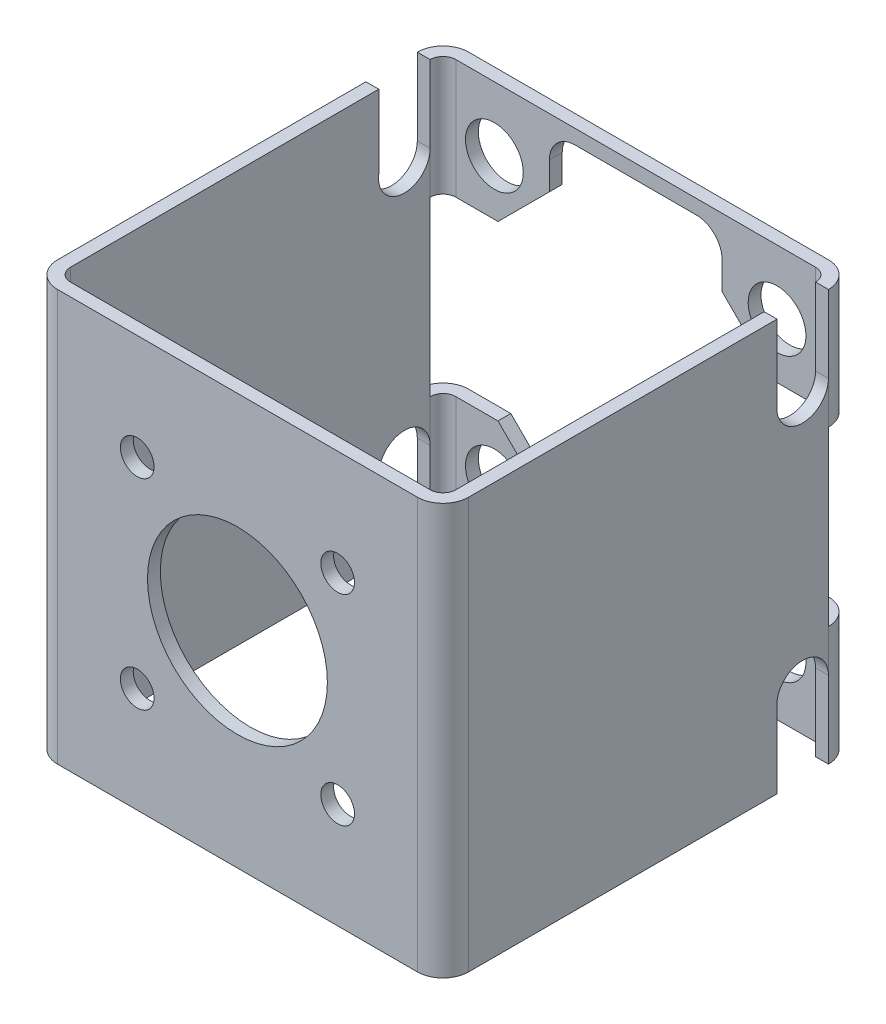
ISO-10303-21;
HEADER;
FILE_DESCRIPTION(('STEP AP214'),'2;1');
FILE_NAME('part.step','',(''),(''),'','','');
FILE_SCHEMA(('AUTOMOTIVE_DESIGN { 1 0 10303 214 1 1 1 1 }'));
ENDSEC;
DATA;
#1=APPLICATION_CONTEXT('core data for automotive mechanical design processes');
#2=APPLICATION_PROTOCOL_DEFINITION('international standard','automotive_design',2000,#1);
#3=PRODUCT_CONTEXT('',#1,'mechanical');
#4=PRODUCT('Part','Part','',(#3));
#5=PRODUCT_RELATED_PRODUCT_CATEGORY('part','',(#4));
#6=PRODUCT_DEFINITION_FORMATION('','',#4);
#7=PRODUCT_DEFINITION_CONTEXT('part definition',#1,'design');
#8=PRODUCT_DEFINITION('design','',#6,#7);
#9=PRODUCT_DEFINITION_SHAPE('','',#8);
#10=(LENGTH_UNIT() NAMED_UNIT(*) SI_UNIT(.MILLI.,.METRE.));
#11=(NAMED_UNIT(*) PLANE_ANGLE_UNIT() SI_UNIT($,.RADIAN.));
#12=(NAMED_UNIT(*) SI_UNIT($,.STERADIAN.) SOLID_ANGLE_UNIT());
#13=UNCERTAINTY_MEASURE_WITH_UNIT(LENGTH_MEASURE(1.E-05),#10,'distance_accuracy_value','');
#14=(GEOMETRIC_REPRESENTATION_CONTEXT(3) GLOBAL_UNCERTAINTY_ASSIGNED_CONTEXT((#13)) GLOBAL_UNIT_ASSIGNED_CONTEXT((#10,
#11,#12)) REPRESENTATION_CONTEXT('',''));
#15=CARTESIAN_POINT('',(0.,0.,0.));
#16=DIRECTION('',(0.,0.,1.));
#17=DIRECTION('',(1.,0.,0.));
#18=AXIS2_PLACEMENT_3D('',#15,#16,#17);
#19=CARTESIAN_POINT('',(-50.8,-50.8,-50.8));
#20=DIRECTION('',(0.,1.,0.));
#21=DIRECTION('',(0.,0.,1.));
#22=AXIS2_PLACEMENT_3D('',#19,#20,#21);
#23=PLANE('',#22);
#24=CARTESIAN_POINT('',(44.45,-50.8,-44.45));
#25=DIRECTION('',(0.,1.,0.));
#26=DIRECTION('',(0.,0.,1.));
#27=AXIS2_PLACEMENT_3D('',#24,#25,#26);
#28=CIRCLE('',#27,6.35);
#29=CARTESIAN_POINT('',(44.45,-50.8,-50.8));
#30=VERTEX_POINT('',#29);
#31=CARTESIAN_POINT('',(50.8,-50.8,-44.45));
#32=VERTEX_POINT('',#31);
#33=EDGE_CURVE('E671',#30,#32,#28,.F.);
#34=ORIENTED_EDGE('',*,*,#33,.T.);
#35=DIRECTION('',(1.,0.,0.));
#36=VECTOR('',#35,1.);
#37=CARTESIAN_POINT('',(-50.8,-50.8,-44.45));
#38=LINE('',#37,#36);
#39=CARTESIAN_POINT('',(47.625,-50.8,-44.45));
#40=VERTEX_POINT('',#39);
#41=EDGE_CURVE('E397',#40,#32,#38,.T.);
#42=ORIENTED_EDGE('',*,*,#41,.F.);
#43=CARTESIAN_POINT('',(44.45,-50.8,-44.45));
#44=DIRECTION('',(0.,1.,0.));
#45=DIRECTION('',(0.,0.,1.));
#46=AXIS2_PLACEMENT_3D('',#43,#44,#45);
#47=CIRCLE('',#46,3.175);
#48=CARTESIAN_POINT('',(44.45,-50.8,-47.625));
#49=VERTEX_POINT('',#48);
#50=EDGE_CURVE('E737',#40,#49,#47,.T.);
#51=ORIENTED_EDGE('',*,*,#50,.T.);
#52=DIRECTION('',(-1.,0.,0.));
#53=VECTOR('',#52,1.);
#54=CARTESIAN_POINT('',(-47.625,-50.8,-47.625));
#55=LINE('',#54,#53);
#56=CARTESIAN_POINT('',(-44.45,-50.8,-47.625));
#57=VERTEX_POINT('',#56);
#58=EDGE_CURVE('E622',#49,#57,#55,.T.);
#59=ORIENTED_EDGE('',*,*,#58,.T.);
#60=CARTESIAN_POINT('',(-44.45,-50.8,-44.45));
#61=DIRECTION('',(0.,1.,0.));
#62=DIRECTION('',(0.,0.,1.));
#63=AXIS2_PLACEMENT_3D('',#60,#61,#62);
#64=CIRCLE('',#63,3.175);
#65=CARTESIAN_POINT('',(-47.625,-50.8,-44.45));
#66=VERTEX_POINT('',#65);
#67=EDGE_CURVE('E742',#57,#66,#64,.T.);
#68=ORIENTED_EDGE('',*,*,#67,.T.);
#69=CARTESIAN_POINT('',(-50.8,-50.8,-44.45));
#70=VERTEX_POINT('',#69);
#71=EDGE_CURVE('E395',#70,#66,#38,.T.);
#72=ORIENTED_EDGE('',*,*,#71,.F.);
#73=CARTESIAN_POINT('',(-44.45,-50.8,-44.45));
#74=DIRECTION('',(0.,1.,0.));
#75=DIRECTION('',(0.,0.,1.));
#76=AXIS2_PLACEMENT_3D('',#73,#74,#75);
#77=CIRCLE('',#76,6.35);
#78=CARTESIAN_POINT('',(-44.45,-50.8,-50.8));
#79=VERTEX_POINT('',#78);
#80=EDGE_CURVE('E669',#70,#79,#77,.F.);
#81=ORIENTED_EDGE('',*,*,#80,.T.);
#82=DIRECTION('',(-1.,0.,0.));
#83=VECTOR('',#82,1.);
#84=CARTESIAN_POINT('',(-50.8,-50.8,-50.8));
#85=LINE('',#84,#83);
#86=EDGE_CURVE('E631',#30,#79,#85,.T.);
#87=ORIENTED_EDGE('',*,*,#86,.F.);
#88=EDGE_LOOP('',(#34,#42,#51,#59,#68,#72,#81,#87));
#89=FACE_BOUND('',#88,.T.);
#90=ADVANCED_FACE('F30',(#89),#23,.F.);
#91=CARTESIAN_POINT('',(-50.8,50.8,-50.8));
#92=DIRECTION('',(0.,1.,0.));
#93=DIRECTION('',(0.,0.,1.));
#94=AXIS2_PLACEMENT_3D('',#91,#92,#93);
#95=PLANE('',#94);
#96=DIRECTION('',(1.,0.,0.));
#97=VECTOR('',#96,1.);
#98=CARTESIAN_POINT('',(-50.8,50.8,-31.75));
#99=LINE('',#98,#97);
#100=CARTESIAN_POINT('',(-50.8,50.8,-31.75));
#101=VERTEX_POINT('',#100);
#102=CARTESIAN_POINT('',(-47.625,50.8,-31.75));
#103=VERTEX_POINT('',#102);
#104=EDGE_CURVE('E432',#101,#103,#99,.T.);
#105=ORIENTED_EDGE('',*,*,#104,.F.);
#106=DIRECTION('',(0.,0.,1.));
#107=VECTOR('',#106,1.);
#108=CARTESIAN_POINT('',(-50.8,50.8,-50.8));
#109=LINE('',#108,#107);
#110=CARTESIAN_POINT('',(-50.8,50.8,44.45));
#111=VERTEX_POINT('',#110);
#112=EDGE_CURVE('E645',#101,#111,#109,.T.);
#113=ORIENTED_EDGE('',*,*,#112,.T.);
#114=CARTESIAN_POINT('',(-44.45,50.8,44.45));
#115=DIRECTION('',(0.,1.,0.));
#116=DIRECTION('',(0.,0.,1.));
#117=AXIS2_PLACEMENT_3D('',#114,#115,#116);
#118=CIRCLE('',#117,6.35);
#119=CARTESIAN_POINT('',(-44.45,50.8,50.8));
#120=VERTEX_POINT('',#119);
#121=EDGE_CURVE('E682',#111,#120,#118,.T.);
#122=ORIENTED_EDGE('',*,*,#121,.T.);
#123=DIRECTION('',(1.,0.,0.));
#124=VECTOR('',#123,1.);
#125=CARTESIAN_POINT('',(-50.8,50.8,50.8));
#126=LINE('',#125,#124);
#127=CARTESIAN_POINT('',(44.45,50.8,50.8));
#128=VERTEX_POINT('',#127);
#129=EDGE_CURVE('E647',#120,#128,#126,.T.);
#130=ORIENTED_EDGE('',*,*,#129,.T.);
#131=CARTESIAN_POINT('',(44.45,50.8,44.45));
#132=DIRECTION('',(0.,1.,0.));
#133=DIRECTION('',(0.,0.,1.));
#134=AXIS2_PLACEMENT_3D('',#131,#132,#133);
#135=CIRCLE('',#134,6.35);
#136=CARTESIAN_POINT('',(50.8,50.8,44.45));
#137=VERTEX_POINT('',#136);
#138=EDGE_CURVE('E679',#128,#137,#135,.T.);
#139=ORIENTED_EDGE('',*,*,#138,.T.);
#140=DIRECTION('',(0.,0.,-1.));
#141=VECTOR('',#140,1.);
#142=CARTESIAN_POINT('',(50.8,50.8,-50.8));
#143=LINE('',#142,#141);
#144=CARTESIAN_POINT('',(50.8,50.8,-31.75));
#145=VERTEX_POINT('',#144);
#146=EDGE_CURVE('E650',#137,#145,#143,.T.);
#147=ORIENTED_EDGE('',*,*,#146,.T.);
#148=CARTESIAN_POINT('',(47.625,50.8,-31.75));
#149=VERTEX_POINT('',#148);
#150=EDGE_CURVE('E434',#149,#145,#99,.T.);
#151=ORIENTED_EDGE('',*,*,#150,.F.);
#152=DIRECTION('',(0.,0.,-1.));
#153=VECTOR('',#152,1.);
#154=CARTESIAN_POINT('',(47.625,50.8,-47.625));
#155=LINE('',#154,#153);
#156=CARTESIAN_POINT('',(47.625,50.8,44.45));
#157=VERTEX_POINT('',#156);
#158=EDGE_CURVE('E639',#157,#149,#155,.T.);
#159=ORIENTED_EDGE('',*,*,#158,.F.);
#160=CARTESIAN_POINT('',(44.45,50.8,44.45));
#161=DIRECTION('',(0.,1.,0.));
#162=DIRECTION('',(0.,0.,1.));
#163=AXIS2_PLACEMENT_3D('',#160,#161,#162);
#164=CIRCLE('',#163,3.175);
#165=CARTESIAN_POINT('',(44.45,50.8,47.625));
#166=VERTEX_POINT('',#165);
#167=EDGE_CURVE('E735',#157,#166,#164,.F.);
#168=ORIENTED_EDGE('',*,*,#167,.T.);
#169=DIRECTION('',(1.,0.,0.));
#170=VECTOR('',#169,1.);
#171=CARTESIAN_POINT('',(-47.625,50.8,47.625));
#172=LINE('',#171,#170);
#173=CARTESIAN_POINT('',(-44.45,50.8,47.625));
#174=VERTEX_POINT('',#173);
#175=EDGE_CURVE('E636',#174,#166,#172,.T.);
#176=ORIENTED_EDGE('',*,*,#175,.F.);
#177=CARTESIAN_POINT('',(-44.45,50.8,44.45));
#178=DIRECTION('',(0.,1.,0.));
#179=DIRECTION('',(0.,0.,1.));
#180=AXIS2_PLACEMENT_3D('',#177,#178,#179);
#181=CIRCLE('',#180,3.175);
#182=CARTESIAN_POINT('',(-47.625,50.8,44.45));
#183=VERTEX_POINT('',#182);
#184=EDGE_CURVE('E730',#174,#183,#181,.F.);
#185=ORIENTED_EDGE('',*,*,#184,.T.);
#186=DIRECTION('',(0.,0.,1.));
#187=VECTOR('',#186,1.);
#188=CARTESIAN_POINT('',(-47.625,50.8,-47.625));
#189=LINE('',#188,#187);
#190=EDGE_CURVE('E634',#103,#183,#189,.T.);
#191=ORIENTED_EDGE('',*,*,#190,.F.);
#192=EDGE_LOOP('',(#105,#113,#122,#130,#139,#147,#151,#159,#168,#176,#185,#191));
#193=FACE_BOUND('',#192,.T.);
#194=ADVANCED_FACE('F809',(#193),#95,.T.);
#195=CARTESIAN_POINT('',(44.45,50.8,-44.45));
#196=DIRECTION('',(0.,-1.,0.));
#197=DIRECTION('',(0.,0.,-1.));
#198=AXIS2_PLACEMENT_3D('',#195,#196,#197);
#199=CYLINDRICAL_SURFACE('',#198,6.35);
#200=CARTESIAN_POINT('',(44.45,21.336,-44.45));
#201=DIRECTION('',(0.,1.,0.));
#202=DIRECTION('',(0.,0.,1.));
#203=AXIS2_PLACEMENT_3D('',#200,#201,#202);
#204=CIRCLE('',#203,6.35);
#205=CARTESIAN_POINT('',(44.45,21.336,-50.8));
#206=VERTEX_POINT('',#205);
#207=CARTESIAN_POINT('',(50.8,21.336,-44.45));
#208=VERTEX_POINT('',#207);
#209=EDGE_CURVE('E455',#206,#208,#204,.F.);
#210=ORIENTED_EDGE('',*,*,#209,.F.);
#211=DIRECTION('',(0.,-1.,0.));
#212=VECTOR('',#211,1.);
#213=CARTESIAN_POINT('',(44.45,50.8,-50.8));
#214=LINE('',#213,#212);
#215=CARTESIAN_POINT('',(44.45,50.8,-50.8));
#216=VERTEX_POINT('',#215);
#217=EDGE_CURVE('E661',#216,#206,#214,.T.);
#218=ORIENTED_EDGE('',*,*,#217,.F.);
#219=CARTESIAN_POINT('',(44.45,50.8,-44.45));
#220=DIRECTION('',(0.,1.,0.));
#221=DIRECTION('',(0.,0.,1.));
#222=AXIS2_PLACEMENT_3D('',#219,#220,#221);
#223=CIRCLE('',#222,6.35);
#224=CARTESIAN_POINT('',(50.8,50.8,-44.45));
#225=VERTEX_POINT('',#224);
#226=EDGE_CURVE('E687',#225,#216,#223,.T.);
#227=ORIENTED_EDGE('',*,*,#226,.F.);
#228=DIRECTION('',(0.,1.,0.));
#229=VECTOR('',#228,1.);
#230=CARTESIAN_POINT('',(50.8,50.8,-44.45));
#231=LINE('',#230,#229);
#232=CARTESIAN_POINT('',(50.8,31.7754861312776,-44.45));
#233=VERTEX_POINT('',#232);
#234=EDGE_CURVE('E415',#233,#225,#231,.T.);
#235=ORIENTED_EDGE('',*,*,#234,.F.);
#236=DIRECTION('',(0.,-1.,0.));
#237=VECTOR('',#236,1.);
#238=CARTESIAN_POINT('',(50.8,50.8,-44.45));
#239=LINE('',#238,#237);
#240=EDGE_CURVE('E676',#208,#233,#239,.F.);
#241=ORIENTED_EDGE('',*,*,#240,.F.);
#242=EDGE_LOOP('',(#210,#218,#227,#235,#241));
#243=FACE_BOUND('',#242,.T.);
#244=ADVANCED_FACE('F872',(#243),#199,.T.);
#245=CARTESIAN_POINT('',(-44.45,50.8,-44.45));
#246=DIRECTION('',(0.,-1.,0.));
#247=DIRECTION('',(0.,0.,-1.));
#248=AXIS2_PLACEMENT_3D('',#245,#246,#247);
#249=CYLINDRICAL_SURFACE('',#248,6.35);
#250=CARTESIAN_POINT('',(-44.45,21.336,-44.45));
#251=DIRECTION('',(0.,1.,0.));
#252=DIRECTION('',(0.,0.,1.));
#253=AXIS2_PLACEMENT_3D('',#250,#251,#252);
#254=CIRCLE('',#253,6.35);
#255=CARTESIAN_POINT('',(-50.8,21.336,-44.45));
#256=VERTEX_POINT('',#255);
#257=CARTESIAN_POINT('',(-44.45,21.336,-50.8));
#258=VERTEX_POINT('',#257);
#259=EDGE_CURVE('E453',#256,#258,#254,.F.);
#260=ORIENTED_EDGE('',*,*,#259,.F.);
#261=DIRECTION('',(0.,-1.,0.));
#262=VECTOR('',#261,1.);
#263=CARTESIAN_POINT('',(-50.8,50.8,-44.45));
#264=LINE('',#263,#262);
#265=CARTESIAN_POINT('',(-50.8,31.7754861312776,-44.45));
#266=VERTEX_POINT('',#265);
#267=EDGE_CURVE('E696',#266,#256,#264,.T.);
#268=ORIENTED_EDGE('',*,*,#267,.F.);
#269=CARTESIAN_POINT('',(-50.8,50.8,-44.45));
#270=VERTEX_POINT('',#269);
#271=EDGE_CURVE('E693',#270,#266,#264,.T.);
#272=ORIENTED_EDGE('',*,*,#271,.F.);
#273=CARTESIAN_POINT('',(-44.45,50.8,-44.45));
#274=DIRECTION('',(0.,1.,0.));
#275=DIRECTION('',(0.,0.,1.));
#276=AXIS2_PLACEMENT_3D('',#273,#274,#275);
#277=CIRCLE('',#276,6.35);
#278=CARTESIAN_POINT('',(-44.45,50.8,-50.8));
#279=VERTEX_POINT('',#278);
#280=EDGE_CURVE('E684',#279,#270,#277,.T.);
#281=ORIENTED_EDGE('',*,*,#280,.F.);
#282=DIRECTION('',(0.,-1.,0.));
#283=VECTOR('',#282,1.);
#284=CARTESIAN_POINT('',(-44.45,50.8,-50.8));
#285=LINE('',#284,#283);
#286=EDGE_CURVE('E656',#258,#279,#285,.F.);
#287=ORIENTED_EDGE('',*,*,#286,.F.);
#288=EDGE_LOOP('',(#260,#268,#272,#281,#287));
#289=FACE_BOUND('',#288,.T.);
#290=ADVANCED_FACE('F954',(#289),#249,.T.);
#291=CARTESIAN_POINT('',(44.45,50.8,-44.45));
#292=DIRECTION('',(0.,1.,0.));
#293=DIRECTION('',(0.,0.,1.));
#294=AXIS2_PLACEMENT_3D('',#291,#292,#293);
#295=CYLINDRICAL_SURFACE('',#294,3.175);
#296=DIRECTION('',(0.,-1.,0.));
#297=VECTOR('',#296,1.);
#298=CARTESIAN_POINT('',(44.45,50.8,-47.625));
#299=LINE('',#298,#297);
#300=CARTESIAN_POINT('',(44.45,21.336,-47.625));
#301=VERTEX_POINT('',#300);
#302=CARTESIAN_POINT('',(44.45,50.8,-47.625));
#303=VERTEX_POINT('',#302);
#304=EDGE_CURVE('E724',#301,#303,#299,.F.);
#305=ORIENTED_EDGE('',*,*,#304,.F.);
#306=CARTESIAN_POINT('',(44.45,21.336,-44.45));
#307=DIRECTION('',(0.,1.,0.));
#308=DIRECTION('',(0.,0.,1.));
#309=AXIS2_PLACEMENT_3D('',#306,#307,#308);
#310=CIRCLE('',#309,3.175);
#311=CARTESIAN_POINT('',(47.625,21.336,-44.45));
#312=VERTEX_POINT('',#311);
#313=EDGE_CURVE('E459',#301,#312,#310,.F.);
#314=ORIENTED_EDGE('',*,*,#313,.T.);
#315=DIRECTION('',(0.,-1.,0.));
#316=VECTOR('',#315,1.);
#317=CARTESIAN_POINT('',(47.625,-50.8,-44.45));
#318=LINE('',#317,#316);
#319=CARTESIAN_POINT('',(47.625,31.7754861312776,-44.45));
#320=VERTEX_POINT('',#319);
#321=EDGE_CURVE('E718',#320,#312,#318,.T.);
#322=ORIENTED_EDGE('',*,*,#321,.F.);
#323=CARTESIAN_POINT('',(47.625,50.8,-44.45));
#324=VERTEX_POINT('',#323);
#325=EDGE_CURVE('E715',#324,#320,#318,.T.);
#326=ORIENTED_EDGE('',*,*,#325,.F.);
#327=CARTESIAN_POINT('',(44.45,50.8,-44.45));
#328=DIRECTION('',(0.,1.,0.));
#329=DIRECTION('',(0.,0.,1.));
#330=AXIS2_PLACEMENT_3D('',#327,#328,#329);
#331=CIRCLE('',#330,3.175);
#332=EDGE_CURVE('E739',#303,#324,#331,.F.);
#333=ORIENTED_EDGE('',*,*,#332,.F.);
#334=EDGE_LOOP('',(#305,#314,#322,#326,#333));
#335=FACE_BOUND('',#334,.T.);
#336=ADVANCED_FACE('F886',(#335),#295,.F.);
#337=CARTESIAN_POINT('',(-44.45,50.8,-44.45));
#338=DIRECTION('',(0.,1.,0.));
#339=DIRECTION('',(0.,0.,1.));
#340=AXIS2_PLACEMENT_3D('',#337,#338,#339);
#341=CYLINDRICAL_SURFACE('',#340,3.175);
#342=DIRECTION('',(0.,-1.,0.));
#343=VECTOR('',#342,1.);
#344=CARTESIAN_POINT('',(-47.625,50.8,-44.45));
#345=LINE('',#344,#343);
#346=CARTESIAN_POINT('',(-47.625,21.336,-44.45));
#347=VERTEX_POINT('',#346);
#348=CARTESIAN_POINT('',(-47.625,31.7754861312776,-44.45));
#349=VERTEX_POINT('',#348);
#350=EDGE_CURVE('E701',#347,#349,#345,.F.);
#351=ORIENTED_EDGE('',*,*,#350,.F.);
#352=CARTESIAN_POINT('',(-44.45,21.336,-44.45));
#353=DIRECTION('',(0.,1.,0.));
#354=DIRECTION('',(0.,0.,1.));
#355=AXIS2_PLACEMENT_3D('',#352,#353,#354);
#356=CIRCLE('',#355,3.175);
#357=CARTESIAN_POINT('',(-44.45,21.336,-47.625));
#358=VERTEX_POINT('',#357);
#359=EDGE_CURVE('E457',#347,#358,#356,.F.);
#360=ORIENTED_EDGE('',*,*,#359,.T.);
#361=DIRECTION('',(0.,-1.,0.));
#362=VECTOR('',#361,1.);
#363=CARTESIAN_POINT('',(-44.45,-50.8,-47.625));
#364=LINE('',#363,#362);
#365=CARTESIAN_POINT('',(-44.45,50.8,-47.625));
#366=VERTEX_POINT('',#365);
#367=EDGE_CURVE('E721',#366,#358,#364,.T.);
#368=ORIENTED_EDGE('',*,*,#367,.F.);
#369=CARTESIAN_POINT('',(-44.45,50.8,-44.45));
#370=DIRECTION('',(0.,1.,0.));
#371=DIRECTION('',(0.,0.,1.));
#372=AXIS2_PLACEMENT_3D('',#369,#370,#371);
#373=CIRCLE('',#372,3.175);
#374=CARTESIAN_POINT('',(-47.625,50.8,-44.45));
#375=VERTEX_POINT('',#374);
#376=EDGE_CURVE('E745',#375,#366,#373,.F.);
#377=ORIENTED_EDGE('',*,*,#376,.F.);
#378=DIRECTION('',(0.,1.,0.));
#379=VECTOR('',#378,1.);
#380=CARTESIAN_POINT('',(-47.625,50.8,-44.45));
#381=LINE('',#380,#379);
#382=EDGE_CURVE('E430',#349,#375,#381,.T.);
#383=ORIENTED_EDGE('',*,*,#382,.F.);
#384=EDGE_LOOP('',(#351,#360,#368,#377,#383));
#385=FACE_BOUND('',#384,.T.);
#386=ADVANCED_FACE('F963',(#385),#341,.F.);
#387=CARTESIAN_POINT('',(-50.8,50.8,-50.8));
#388=DIRECTION('',(0.,0.,1.));
#389=DIRECTION('',(1.,0.,0.));
#390=AXIS2_PLACEMENT_3D('',#387,#388,#389);
#391=PLANE('',#390);
#392=CARTESIAN_POINT('',(34.925,34.925,-50.8));
#393=DIRECTION('',(0.,0.,-1.));
#394=DIRECTION('',(-1.,0.,0.));
#395=AXIS2_PLACEMENT_3D('',#392,#393,#394);
#396=CIRCLE('',#395,7.1374);
#397=CARTESIAN_POINT('',(27.7876,34.925,-50.8));
#398=VERTEX_POINT('',#397);
#399=EDGE_CURVE('E483',#398,#398,#396,.T.);
#400=ORIENTED_EDGE('',*,*,#399,.F.);
#401=EDGE_LOOP('',(#400));
#402=FACE_BOUND('',#401,.T.);
#403=CARTESIAN_POINT('',(-34.925,34.925,-50.8));
#404=DIRECTION('',(0.,0.,-1.));
#405=DIRECTION('',(-1.,0.,0.));
#406=AXIS2_PLACEMENT_3D('',#403,#404,#405);
#407=CIRCLE('',#406,7.1374);
#408=CARTESIAN_POINT('',(-42.0624,34.925,-50.8));
#409=VERTEX_POINT('',#408);
#410=EDGE_CURVE('E501',#409,#409,#407,.T.);
#411=ORIENTED_EDGE('',*,*,#410,.F.);
#412=EDGE_LOOP('',(#411));
#413=FACE_BOUND('',#412,.T.);
#414=DIRECTION('',(0.,1.,0.));
#415=VECTOR('',#414,1.);
#416=CARTESIAN_POINT('',(-21.336,47.244,-50.8));
#417=LINE('',#416,#415);
#418=CARTESIAN_POINT('',(-21.336,34.036,-50.8));
#419=VERTEX_POINT('',#418);
#420=CARTESIAN_POINT('',(-21.336,40.894,-50.8));
#421=VERTEX_POINT('',#420);
#422=EDGE_CURVE('E561',#419,#421,#417,.T.);
#423=ORIENTED_EDGE('',*,*,#422,.F.);
#424=DIRECTION('',(0.707106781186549,0.707106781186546,0.));
#425=VECTOR('',#424,1.);
#426=CARTESIAN_POINT('',(-21.336,34.036,-50.8));
#427=LINE('',#426,#425);
#428=CARTESIAN_POINT('',(-34.0360000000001,21.336,-50.8));
#429=VERTEX_POINT('',#428);
#430=EDGE_CURVE('E509',#429,#419,#427,.T.);
#431=ORIENTED_EDGE('',*,*,#430,.F.);
#432=DIRECTION('',(1.,0.,0.));
#433=VECTOR('',#432,1.);
#434=CARTESIAN_POINT('',(-21.336,21.336,-50.8));
#435=LINE('',#434,#433);
#436=EDGE_CURVE('E558',#258,#429,#435,.T.);
#437=ORIENTED_EDGE('',*,*,#436,.F.);
#438=ORIENTED_EDGE('',*,*,#286,.T.);
#439=DIRECTION('',(-1.,0.,0.));
#440=VECTOR('',#439,1.);
#441=CARTESIAN_POINT('',(-50.8,50.8,-50.8));
#442=LINE('',#441,#440);
#443=EDGE_CURVE('E653',#216,#279,#442,.T.);
#444=ORIENTED_EDGE('',*,*,#443,.F.);
#445=ORIENTED_EDGE('',*,*,#217,.T.);
#446=DIRECTION('',(1.,0.,0.));
#447=VECTOR('',#446,1.);
#448=CARTESIAN_POINT('',(44.45,21.336,-50.8));
#449=LINE('',#448,#447);
#450=CARTESIAN_POINT('',(34.036,21.336,-50.8));
#451=VERTEX_POINT('',#450);
#452=EDGE_CURVE('E569',#451,#206,#449,.T.);
#453=ORIENTED_EDGE('',*,*,#452,.F.);
#454=DIRECTION('',(0.707106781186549,-0.707106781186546,0.));
#455=VECTOR('',#454,1.);
#456=CARTESIAN_POINT('',(21.336,34.036,-50.8));
#457=LINE('',#456,#455);
#458=CARTESIAN_POINT('',(21.336,34.036,-50.8));
#459=VERTEX_POINT('',#458);
#460=EDGE_CURVE('E519',#459,#451,#457,.T.);
#461=ORIENTED_EDGE('',*,*,#460,.F.);
#462=DIRECTION('',(0.,-1.,0.));
#463=VECTOR('',#462,1.);
#464=CARTESIAN_POINT('',(21.336,47.244,-50.8));
#465=LINE('',#464,#463);
#466=CARTESIAN_POINT('',(21.336,40.894,-50.8));
#467=VERTEX_POINT('',#466);
#468=EDGE_CURVE('E567',#467,#459,#465,.T.);
#469=ORIENTED_EDGE('',*,*,#468,.F.);
#470=CARTESIAN_POINT('',(14.986,40.894,-50.8));
#471=DIRECTION('',(0.,0.,1.));
#472=DIRECTION('',(1.,0.,0.));
#473=AXIS2_PLACEMENT_3D('',#470,#471,#472);
#474=CIRCLE('',#473,6.35);
#475=CARTESIAN_POINT('',(14.986,47.244,-50.8));
#476=VERTEX_POINT('',#475);
#477=EDGE_CURVE('E787',#467,#476,#474,.T.);
#478=ORIENTED_EDGE('',*,*,#477,.T.);
#479=DIRECTION('',(1.,0.,0.));
#480=VECTOR('',#479,1.);
#481=CARTESIAN_POINT('',(21.336,47.244,-50.8));
#482=LINE('',#481,#480);
#483=CARTESIAN_POINT('',(-14.986,47.244,-50.8));
#484=VERTEX_POINT('',#483);
#485=EDGE_CURVE('E564',#484,#476,#482,.T.);
#486=ORIENTED_EDGE('',*,*,#485,.F.);
#487=CARTESIAN_POINT('',(-14.986,40.894,-50.8));
#488=DIRECTION('',(0.,0.,1.));
#489=DIRECTION('',(1.,0.,0.));
#490=AXIS2_PLACEMENT_3D('',#487,#488,#489);
#491=CIRCLE('',#490,6.35);
#492=EDGE_CURVE('E783',#484,#421,#491,.T.);
#493=ORIENTED_EDGE('',*,*,#492,.T.);
#494=EDGE_LOOP('',(#423,#431,#437,#438,#444,#445,#453,#461,#469,#478,#486,#493));
#495=FACE_BOUND('',#494,.T.);
#496=ADVANCED_FACE('F958',(#402,#413,#495),#391,.F.);
#497=CARTESIAN_POINT('',(-47.625,50.8,-47.625));
#498=DIRECTION('',(0.,0.,1.));
#499=DIRECTION('',(1.,0.,0.));
#500=AXIS2_PLACEMENT_3D('',#497,#498,#499);
#501=PLANE('',#500);
#502=CARTESIAN_POINT('',(34.925,34.925,-47.625));
#503=DIRECTION('',(0.,0.,1.));
#504=DIRECTION('',(1.,0.,0.));
#505=AXIS2_PLACEMENT_3D('',#502,#503,#504);
#506=CIRCLE('',#505,7.1374);
#507=CARTESIAN_POINT('',(42.0624,34.925,-47.625));
#508=VERTEX_POINT('',#507);
#509=EDGE_CURVE('E480',#508,#508,#506,.F.);
#510=ORIENTED_EDGE('',*,*,#509,.T.);
#511=EDGE_LOOP('',(#510));
#512=FACE_BOUND('',#511,.T.);
#513=CARTESIAN_POINT('',(-34.925,34.925,-47.625));
#514=DIRECTION('',(0.,0.,1.));
#515=DIRECTION('',(1.,0.,0.));
#516=AXIS2_PLACEMENT_3D('',#513,#514,#515);
#517=CIRCLE('',#516,7.1374);
#518=CARTESIAN_POINT('',(-27.7876,34.925,-47.625));
#519=VERTEX_POINT('',#518);
#520=EDGE_CURVE('E496',#519,#519,#517,.F.);
#521=ORIENTED_EDGE('',*,*,#520,.T.);
#522=EDGE_LOOP('',(#521));
#523=FACE_BOUND('',#522,.T.);
#524=DIRECTION('',(0.707106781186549,0.707106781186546,0.));
#525=VECTOR('',#524,1.);
#526=CARTESIAN_POINT('',(-21.336,34.036,-47.625));
#527=LINE('',#526,#525);
#528=CARTESIAN_POINT('',(-34.036,21.336,-47.625));
#529=VERTEX_POINT('',#528);
#530=CARTESIAN_POINT('',(-21.336,34.036,-47.625));
#531=VERTEX_POINT('',#530);
#532=EDGE_CURVE('E511',#529,#531,#527,.T.);
#533=ORIENTED_EDGE('',*,*,#532,.T.);
#534=DIRECTION('',(0.,-1.,0.));
#535=VECTOR('',#534,1.);
#536=CARTESIAN_POINT('',(-21.336,50.8,-47.625));
#537=LINE('',#536,#535);
#538=CARTESIAN_POINT('',(-21.336,40.894,-47.625));
#539=VERTEX_POINT('',#538);
#540=EDGE_CURVE('E755',#539,#531,#537,.T.);
#541=ORIENTED_EDGE('',*,*,#540,.F.);
#542=CARTESIAN_POINT('',(-14.986,40.894,-47.625));
#543=DIRECTION('',(0.,0.,1.));
#544=DIRECTION('',(1.,0.,0.));
#545=AXIS2_PLACEMENT_3D('',#542,#543,#544);
#546=CIRCLE('',#545,6.35);
#547=CARTESIAN_POINT('',(-14.986,47.244,-47.625));
#548=VERTEX_POINT('',#547);
#549=EDGE_CURVE('E785',#539,#548,#546,.F.);
#550=ORIENTED_EDGE('',*,*,#549,.T.);
#551=DIRECTION('',(-1.,0.,0.));
#552=VECTOR('',#551,1.);
#553=CARTESIAN_POINT('',(-47.625,47.244,-47.625));
#554=LINE('',#553,#552);
#555=CARTESIAN_POINT('',(14.986,47.244,-47.625));
#556=VERTEX_POINT('',#555);
#557=EDGE_CURVE('E757',#556,#548,#554,.T.);
#558=ORIENTED_EDGE('',*,*,#557,.F.);
#559=CARTESIAN_POINT('',(14.986,40.894,-47.625));
#560=DIRECTION('',(0.,0.,1.));
#561=DIRECTION('',(1.,0.,0.));
#562=AXIS2_PLACEMENT_3D('',#559,#560,#561);
#563=CIRCLE('',#562,6.35);
#564=CARTESIAN_POINT('',(21.336,40.894,-47.625));
#565=VERTEX_POINT('',#564);
#566=EDGE_CURVE('E789',#556,#565,#563,.F.);
#567=ORIENTED_EDGE('',*,*,#566,.T.);
#568=DIRECTION('',(0.,1.,0.));
#569=VECTOR('',#568,1.);
#570=CARTESIAN_POINT('',(21.336,50.8000000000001,-47.625));
#571=LINE('',#570,#569);
#572=CARTESIAN_POINT('',(21.336,34.036,-47.625));
#573=VERTEX_POINT('',#572);
#574=EDGE_CURVE('E760',#573,#565,#571,.T.);
#575=ORIENTED_EDGE('',*,*,#574,.F.);
#576=DIRECTION('',(0.707106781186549,-0.707106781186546,0.));
#577=VECTOR('',#576,1.);
#578=CARTESIAN_POINT('',(21.336,34.036,-47.625));
#579=LINE('',#578,#577);
#580=CARTESIAN_POINT('',(34.036,21.336,-47.625));
#581=VERTEX_POINT('',#580);
#582=EDGE_CURVE('E521',#573,#581,#579,.T.);
#583=ORIENTED_EDGE('',*,*,#582,.T.);
#584=DIRECTION('',(-1.,0.,0.));
#585=VECTOR('',#584,1.);
#586=CARTESIAN_POINT('',(-47.625,21.3359999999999,-47.625));
#587=LINE('',#586,#585);
#588=EDGE_CURVE('E581',#301,#581,#587,.T.);
#589=ORIENTED_EDGE('',*,*,#588,.F.);
#590=ORIENTED_EDGE('',*,*,#304,.T.);
#591=DIRECTION('',(-1.,0.,0.));
#592=VECTOR('',#591,1.);
#593=CARTESIAN_POINT('',(-47.625,50.8,-47.625));
#594=LINE('',#593,#592);
#595=EDGE_CURVE('E642',#303,#366,#594,.T.);
#596=ORIENTED_EDGE('',*,*,#595,.T.);
#597=ORIENTED_EDGE('',*,*,#367,.T.);
#598=DIRECTION('',(-1.,0.,0.));
#599=VECTOR('',#598,1.);
#600=CARTESIAN_POINT('',(-47.625,21.336,-47.625));
#601=LINE('',#600,#599);
#602=EDGE_CURVE('E575',#529,#358,#601,.T.);
#603=ORIENTED_EDGE('',*,*,#602,.F.);
#604=EDGE_LOOP('',(#533,#541,#550,#558,#567,#575,#583,#589,#590,#596,#597,#603));
#605=FACE_BOUND('',#604,.T.);
#606=ADVANCED_FACE('F1027',(#512,#523,#605),#501,.T.);
#607=DIRECTION('',(1.,0.,0.));
#608=VECTOR('',#607,1.);
#609=CARTESIAN_POINT('',(-50.8,50.8,-44.45));
#610=LINE('',#609,#608);
#611=EDGE_CURVE('E438',#324,#225,#610,.T.);
#612=ORIENTED_EDGE('',*,*,#611,.T.);
#613=ORIENTED_EDGE('',*,*,#226,.T.);
#614=ORIENTED_EDGE('',*,*,#443,.T.);
#615=ORIENTED_EDGE('',*,*,#280,.T.);
#616=EDGE_CURVE('E435',#270,#375,#610,.T.);
#617=ORIENTED_EDGE('',*,*,#616,.T.);
#618=ORIENTED_EDGE('',*,*,#376,.T.);
#619=ORIENTED_EDGE('',*,*,#595,.F.);
#620=ORIENTED_EDGE('',*,*,#332,.T.);
#621=EDGE_LOOP('',(#612,#613,#614,#615,#617,#618,#619,#620));
#622=FACE_BOUND('',#621,.T.);
#623=ADVANCED_FACE('F878',(#622),#95,.T.);
#624=CARTESIAN_POINT('',(-50.8,50.8,-50.8));
#625=DIRECTION('',(1.,0.,0.));
#626=DIRECTION('',(0.,0.,-1.));
#627=AXIS2_PLACEMENT_3D('',#624,#625,#626);
#628=PLANE('',#627);
#629=CARTESIAN_POINT('',(-50.8,-21.336,-44.45));
#630=VERTEX_POINT('',#629);
#631=CARTESIAN_POINT('',(-50.8,-31.7754861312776,-44.45));
#632=VERTEX_POINT('',#631);
#633=EDGE_CURVE('E692',#630,#632,#264,.T.);
#634=ORIENTED_EDGE('',*,*,#633,.T.);
#635=CARTESIAN_POINT('',(-50.8,-31.7754861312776,-38.0745138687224));
#636=DIRECTION('',(1.,0.,0.));
#637=DIRECTION('',(0.,0.,-1.));
#638=AXIS2_PLACEMENT_3D('',#635,#636,#637);
#639=CIRCLE('',#638,6.37548613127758);
#640=CARTESIAN_POINT('',(-50.8,-32.5800653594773,-31.75));
#641=VERTEX_POINT('',#640);
#642=EDGE_CURVE('E381',#632,#641,#639,.T.);
#643=ORIENTED_EDGE('',*,*,#642,.T.);
#644=DIRECTION('',(0.,-1.,0.));
#645=VECTOR('',#644,1.);
#646=CARTESIAN_POINT('',(-50.8,-50.8,-31.75));
#647=LINE('',#646,#645);
#648=CARTESIAN_POINT('',(-50.8,-50.8,-31.75));
#649=VERTEX_POINT('',#648);
#650=EDGE_CURVE('E384',#641,#649,#647,.T.);
#651=ORIENTED_EDGE('',*,*,#650,.T.);
#652=DIRECTION('',(0.,0.,1.));
#653=VECTOR('',#652,1.);
#654=CARTESIAN_POINT('',(-50.8,-50.8,-50.8));
#655=LINE('',#654,#653);
#656=CARTESIAN_POINT('',(-50.8,-50.8,44.45));
#657=VERTEX_POINT('',#656);
#658=EDGE_CURVE('E625',#649,#657,#655,.T.);
#659=ORIENTED_EDGE('',*,*,#658,.T.);
#660=DIRECTION('',(0.,-1.,0.));
#661=VECTOR('',#660,1.);
#662=CARTESIAN_POINT('',(-50.8,50.8,44.45));
#663=LINE('',#662,#661);
#664=EDGE_CURVE('E689',#657,#111,#663,.F.);
#665=ORIENTED_EDGE('',*,*,#664,.T.);
#666=ORIENTED_EDGE('',*,*,#112,.F.);
#667=DIRECTION('',(0.,-1.,0.));
#668=VECTOR('',#667,1.);
#669=CARTESIAN_POINT('',(-50.8,50.8,-31.75));
#670=LINE('',#669,#668);
#671=CARTESIAN_POINT('',(-50.8,32.5800653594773,-31.75));
#672=VERTEX_POINT('',#671);
#673=EDGE_CURVE('E423',#101,#672,#670,.T.);
#674=ORIENTED_EDGE('',*,*,#673,.T.);
#675=CARTESIAN_POINT('',(-50.8,31.7754861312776,-38.0745138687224));
#676=DIRECTION('',(1.,0.,0.));
#677=DIRECTION('',(0.,0.,1.));
#678=AXIS2_PLACEMENT_3D('',#675,#676,#677);
#679=CIRCLE('',#678,6.37548613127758);
#680=EDGE_CURVE('E420',#672,#266,#679,.T.);
#681=ORIENTED_EDGE('',*,*,#680,.T.);
#682=ORIENTED_EDGE('',*,*,#267,.T.);
#683=DIRECTION('',(0.,-1.,0.));
#684=VECTOR('',#683,1.);
#685=CARTESIAN_POINT('',(-50.8,50.8,-44.45));
#686=LINE('',#685,#684);
#687=EDGE_CURVE('E474',#256,#630,#686,.T.);
#688=ORIENTED_EDGE('',*,*,#687,.T.);
#689=EDGE_LOOP('',(#634,#643,#651,#659,#665,#666,#674,#681,#682,#688));
#690=FACE_BOUND('',#689,.T.);
#691=ADVANCED_FACE('F32',(#690),#628,.F.);
#692=CARTESIAN_POINT('',(-50.8,50.8,50.8));
#693=DIRECTION('',(0.,0.,-1.));
#694=DIRECTION('',(-1.,0.,0.));
#695=AXIS2_PLACEMENT_3D('',#692,#693,#694);
#696=PLANE('',#695);
#697=CARTESIAN_POINT('',(-24.765,-24.765,50.8));
#698=DIRECTION('',(0.,0.,1.));
#699=DIRECTION('',(1.,0.,0.));
#700=AXIS2_PLACEMENT_3D('',#697,#698,#699);
#701=CIRCLE('',#700,4.1656);
#702=CARTESIAN_POINT('',(-20.5994,-24.765,50.8));
#703=VERTEX_POINT('',#702);
#704=EDGE_CURVE('E587',#703,#703,#701,.T.);
#705=ORIENTED_EDGE('',*,*,#704,.F.);
#706=EDGE_LOOP('',(#705));
#707=FACE_BOUND('',#706,.T.);
#708=CARTESIAN_POINT('',(24.765,-24.765,50.8));
#709=DIRECTION('',(0.,0.,1.));
#710=DIRECTION('',(1.,0.,0.));
#711=AXIS2_PLACEMENT_3D('',#708,#709,#710);
#712=CIRCLE('',#711,4.1656);
#713=CARTESIAN_POINT('',(28.9306,-24.765,50.8));
#714=VERTEX_POINT('',#713);
#715=EDGE_CURVE('E593',#714,#714,#712,.T.);
#716=ORIENTED_EDGE('',*,*,#715,.F.);
#717=EDGE_LOOP('',(#716));
#718=FACE_BOUND('',#717,.T.);
#719=CARTESIAN_POINT('',(24.765,24.765,50.8));
#720=DIRECTION('',(0.,0.,1.));
#721=DIRECTION('',(1.,0.,0.));
#722=AXIS2_PLACEMENT_3D('',#719,#720,#721);
#723=CIRCLE('',#722,4.1656);
#724=CARTESIAN_POINT('',(28.9306,24.765,50.8));
#725=VERTEX_POINT('',#724);
#726=EDGE_CURVE('E599',#725,#725,#723,.T.);
#727=ORIENTED_EDGE('',*,*,#726,.F.);
#728=EDGE_LOOP('',(#727));
#729=FACE_BOUND('',#728,.T.);
#730=CARTESIAN_POINT('',(-24.765,24.765,50.8));
#731=DIRECTION('',(0.,0.,1.));
#732=DIRECTION('',(1.,0.,0.));
#733=AXIS2_PLACEMENT_3D('',#730,#731,#732);
#734=CIRCLE('',#733,4.1656);
#735=CARTESIAN_POINT('',(-20.5994,24.765,50.8));
#736=VERTEX_POINT('',#735);
#737=EDGE_CURVE('E605',#736,#736,#734,.T.);
#738=ORIENTED_EDGE('',*,*,#737,.F.);
#739=EDGE_LOOP('',(#738));
#740=FACE_BOUND('',#739,.T.);
#741=CARTESIAN_POINT('',(0.,0.,50.8));
#742=DIRECTION('',(0.,0.,1.));
#743=DIRECTION('',(1.,0.,0.));
#744=AXIS2_PLACEMENT_3D('',#741,#742,#743);
#745=CIRCLE('',#744,22.225);
#746=CARTESIAN_POINT('',(22.225,0.,50.8));
#747=VERTEX_POINT('',#746);
#748=EDGE_CURVE('E611',#747,#747,#745,.T.);
#749=ORIENTED_EDGE('',*,*,#748,.F.);
#750=EDGE_LOOP('',(#749));
#751=FACE_BOUND('',#750,.T.);
#752=ORIENTED_EDGE('',*,*,#129,.F.);
#753=DIRECTION('',(0.,-1.,0.));
#754=VECTOR('',#753,1.);
#755=CARTESIAN_POINT('',(-44.45,50.8,50.8));
#756=LINE('',#755,#754);
#757=CARTESIAN_POINT('',(-44.45,-50.8,50.8));
#758=VERTEX_POINT('',#757);
#759=EDGE_CURVE('E698',#120,#758,#756,.T.);
#760=ORIENTED_EDGE('',*,*,#759,.T.);
#761=DIRECTION('',(1.,0.,0.));
#762=VECTOR('',#761,1.);
#763=CARTESIAN_POINT('',(-50.8,-50.8,50.8));
#764=LINE('',#763,#762);
#765=CARTESIAN_POINT('',(44.45,-50.8,50.8));
#766=VERTEX_POINT('',#765);
#767=EDGE_CURVE('E627',#758,#766,#764,.T.);
#768=ORIENTED_EDGE('',*,*,#767,.T.);
#769=DIRECTION('',(0.,-1.,0.));
#770=VECTOR('',#769,1.);
#771=CARTESIAN_POINT('',(44.45,50.8,50.8));
#772=LINE('',#771,#770);
#773=EDGE_CURVE('E695',#766,#128,#772,.F.);
#774=ORIENTED_EDGE('',*,*,#773,.T.);
#775=EDGE_LOOP('',(#752,#760,#768,#774));
#776=FACE_BOUND('',#775,.T.);
#777=ADVANCED_FACE('F853',(#707,#718,#729,#740,#751,#776),#696,.F.);
#778=CARTESIAN_POINT('',(50.8,50.8,-50.8));
#779=DIRECTION('',(-1.,0.,0.));
#780=DIRECTION('',(0.,0.,1.));
#781=AXIS2_PLACEMENT_3D('',#778,#779,#780);
#782=PLANE('',#781);
#783=DIRECTION('',(0.,-1.,0.));
#784=VECTOR('',#783,1.);
#785=CARTESIAN_POINT('',(50.8,-50.8,-31.75));
#786=LINE('',#785,#784);
#787=CARTESIAN_POINT('',(50.8,-32.5800653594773,-31.75));
#788=VERTEX_POINT('',#787);
#789=CARTESIAN_POINT('',(50.8,-50.8,-31.75));
#790=VERTEX_POINT('',#789);
#791=EDGE_CURVE('E361',#788,#790,#786,.T.);
#792=ORIENTED_EDGE('',*,*,#791,.F.);
#793=CARTESIAN_POINT('',(50.8,-31.7754861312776,-38.0745138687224));
#794=DIRECTION('',(1.,0.,0.));
#795=DIRECTION('',(0.,0.,-1.));
#796=AXIS2_PLACEMENT_3D('',#793,#794,#795);
#797=CIRCLE('',#796,6.37548613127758);
#798=CARTESIAN_POINT('',(50.8,-31.7754861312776,-44.45));
#799=VERTEX_POINT('',#798);
#800=EDGE_CURVE('E371',#799,#788,#797,.T.);
#801=ORIENTED_EDGE('',*,*,#800,.F.);
#802=CARTESIAN_POINT('',(50.8,-21.336,-44.45));
#803=VERTEX_POINT('',#802);
#804=EDGE_CURVE('E680',#799,#803,#239,.F.);
#805=ORIENTED_EDGE('',*,*,#804,.T.);
#806=DIRECTION('',(0.,-1.,0.));
#807=VECTOR('',#806,1.);
#808=CARTESIAN_POINT('',(50.8,50.8,-44.45));
#809=LINE('',#808,#807);
#810=EDGE_CURVE('E477',#803,#208,#809,.F.);
#811=ORIENTED_EDGE('',*,*,#810,.T.);
#812=ORIENTED_EDGE('',*,*,#240,.T.);
#813=CARTESIAN_POINT('',(50.8,31.7754861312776,-38.0745138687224));
#814=DIRECTION('',(1.,0.,0.));
#815=DIRECTION('',(0.,0.,1.));
#816=AXIS2_PLACEMENT_3D('',#813,#814,#815);
#817=CIRCLE('',#816,6.37548613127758);
#818=CARTESIAN_POINT('',(50.8,32.5800653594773,-31.75));
#819=VERTEX_POINT('',#818);
#820=EDGE_CURVE('E412',#819,#233,#817,.T.);
#821=ORIENTED_EDGE('',*,*,#820,.F.);
#822=DIRECTION('',(0.,-1.,0.));
#823=VECTOR('',#822,1.);
#824=CARTESIAN_POINT('',(50.8,50.8,-31.75));
#825=LINE('',#824,#823);
#826=EDGE_CURVE('E417',#145,#819,#825,.T.);
#827=ORIENTED_EDGE('',*,*,#826,.F.);
#828=ORIENTED_EDGE('',*,*,#146,.F.);
#829=DIRECTION('',(0.,-1.,0.));
#830=VECTOR('',#829,1.);
#831=CARTESIAN_POINT('',(50.8,50.8,44.45));
#832=LINE('',#831,#830);
#833=CARTESIAN_POINT('',(50.8,-50.8,44.45));
#834=VERTEX_POINT('',#833);
#835=EDGE_CURVE('E674',#137,#834,#832,.T.);
#836=ORIENTED_EDGE('',*,*,#835,.T.);
#837=DIRECTION('',(0.,0.,-1.));
#838=VECTOR('',#837,1.);
#839=CARTESIAN_POINT('',(50.8,-50.8,-50.8));
#840=LINE('',#839,#838);
#841=EDGE_CURVE('E380',#834,#790,#840,.T.);
#842=ORIENTED_EDGE('',*,*,#841,.T.);
#843=EDGE_LOOP('',(#792,#801,#805,#811,#812,#821,#827,#828,#836,#842));
#844=FACE_BOUND('',#843,.T.);
#845=ADVANCED_FACE('F377',(#844),#782,.F.);
#846=CARTESIAN_POINT('',(34.925,-34.925,-50.8));
#847=DIRECTION('',(0.,0.,-1.));
#848=DIRECTION('',(-1.,0.,0.));
#849=AXIS2_PLACEMENT_3D('',#846,#847,#848);
#850=CIRCLE('',#849,7.1374);
#851=CARTESIAN_POINT('',(27.7876,-34.925,-50.8));
#852=VERTEX_POINT('',#851);
#853=EDGE_CURVE('E487',#852,#852,#850,.T.);
#854=ORIENTED_EDGE('',*,*,#853,.F.);
#855=EDGE_LOOP('',(#854));
#856=FACE_BOUND('',#855,.T.);
#857=CARTESIAN_POINT('',(-34.925,-34.925,-50.8));
#858=DIRECTION('',(0.,0.,-1.));
#859=DIRECTION('',(-1.,0.,0.));
#860=AXIS2_PLACEMENT_3D('',#857,#858,#859);
#861=CIRCLE('',#860,7.1374);
#862=CARTESIAN_POINT('',(-42.0624,-34.925,-50.8));
#863=VERTEX_POINT('',#862);
#864=EDGE_CURVE('E493',#863,#863,#861,.T.);
#865=ORIENTED_EDGE('',*,*,#864,.F.);
#866=EDGE_LOOP('',(#865));
#867=FACE_BOUND('',#866,.T.);
#868=DIRECTION('',(0.,-1.,0.));
#869=VECTOR('',#868,1.);
#870=CARTESIAN_POINT('',(21.336,-21.336,-50.8));
#871=LINE('',#870,#869);
#872=CARTESIAN_POINT('',(21.336,-34.036,-50.8));
#873=VERTEX_POINT('',#872);
#874=CARTESIAN_POINT('',(21.336,-40.894,-50.8));
#875=VERTEX_POINT('',#874);
#876=EDGE_CURVE('E547',#873,#875,#871,.T.);
#877=ORIENTED_EDGE('',*,*,#876,.F.);
#878=DIRECTION('',(-0.707106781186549,-0.707106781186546,0.));
#879=VECTOR('',#878,1.);
#880=CARTESIAN_POINT('',(21.336,-34.036,-50.8));
#881=LINE('',#880,#879);
#882=CARTESIAN_POINT('',(34.036,-21.336,-50.8));
#883=VERTEX_POINT('',#882);
#884=EDGE_CURVE('E529',#883,#873,#881,.T.);
#885=ORIENTED_EDGE('',*,*,#884,.F.);
#886=DIRECTION('',(-1.,0.,0.));
#887=VECTOR('',#886,1.);
#888=CARTESIAN_POINT('',(44.45,-21.336,-50.8));
#889=LINE('',#888,#887);
#890=CARTESIAN_POINT('',(44.45,-21.336,-50.8));
#891=VERTEX_POINT('',#890);
#892=EDGE_CURVE('E544',#891,#883,#889,.T.);
#893=ORIENTED_EDGE('',*,*,#892,.F.);
#894=EDGE_CURVE('E660',#891,#30,#214,.T.);
#895=ORIENTED_EDGE('',*,*,#894,.T.);
#896=ORIENTED_EDGE('',*,*,#86,.T.);
#897=CARTESIAN_POINT('',(-44.45,-21.336,-50.8));
#898=VERTEX_POINT('',#897);
#899=EDGE_CURVE('E657',#79,#898,#285,.F.);
#900=ORIENTED_EDGE('',*,*,#899,.T.);
#901=DIRECTION('',(-1.,0.,0.));
#902=VECTOR('',#901,1.);
#903=CARTESIAN_POINT('',(-21.336,-21.336,-50.8));
#904=LINE('',#903,#902);
#905=CARTESIAN_POINT('',(-34.0360000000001,-21.336,-50.8));
#906=VERTEX_POINT('',#905);
#907=EDGE_CURVE('E555',#906,#898,#904,.T.);
#908=ORIENTED_EDGE('',*,*,#907,.F.);
#909=DIRECTION('',(-0.707106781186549,0.707106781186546,0.));
#910=VECTOR('',#909,1.);
#911=CARTESIAN_POINT('',(-21.336,-34.036,-50.8));
#912=LINE('',#911,#910);
#913=CARTESIAN_POINT('',(-21.336,-34.036,-50.8));
#914=VERTEX_POINT('',#913);
#915=EDGE_CURVE('E539',#914,#906,#912,.T.);
#916=ORIENTED_EDGE('',*,*,#915,.F.);
#917=DIRECTION('',(0.,1.,0.));
#918=VECTOR('',#917,1.);
#919=CARTESIAN_POINT('',(-21.336,-21.336,-50.8));
#920=LINE('',#919,#918);
#921=CARTESIAN_POINT('',(-21.336,-40.894,-50.8));
#922=VERTEX_POINT('',#921);
#923=EDGE_CURVE('E553',#922,#914,#920,.T.);
#924=ORIENTED_EDGE('',*,*,#923,.F.);
#925=CARTESIAN_POINT('',(-14.986,-40.894,-50.8));
#926=DIRECTION('',(0.,0.,1.));
#927=DIRECTION('',(1.,0.,0.));
#928=AXIS2_PLACEMENT_3D('',#925,#926,#927);
#929=CIRCLE('',#928,6.35);
#930=CARTESIAN_POINT('',(-14.986,-47.244,-50.8));
#931=VERTEX_POINT('',#930);
#932=EDGE_CURVE('E791',#922,#931,#929,.T.);
#933=ORIENTED_EDGE('',*,*,#932,.T.);
#934=DIRECTION('',(-1.,0.,0.));
#935=VECTOR('',#934,1.);
#936=CARTESIAN_POINT('',(21.336,-47.244,-50.8));
#937=LINE('',#936,#935);
#938=CARTESIAN_POINT('',(14.986,-47.244,-50.8));
#939=VERTEX_POINT('',#938);
#940=EDGE_CURVE('E550',#939,#931,#937,.T.);
#941=ORIENTED_EDGE('',*,*,#940,.F.);
#942=CARTESIAN_POINT('',(14.986,-40.894,-50.8));
#943=DIRECTION('',(0.,0.,1.));
#944=DIRECTION('',(1.,0.,0.));
#945=AXIS2_PLACEMENT_3D('',#942,#943,#944);
#946=CIRCLE('',#945,6.35);
#947=EDGE_CURVE('E795',#939,#875,#946,.T.);
#948=ORIENTED_EDGE('',*,*,#947,.T.);
#949=EDGE_LOOP('',(#877,#885,#893,#895,#896,#900,#908,#916,#924,#933,#941,#948));
#950=FACE_BOUND('',#949,.T.);
#951=ADVANCED_FACE('F973',(#856,#867,#950),#391,.F.);
#952=CARTESIAN_POINT('',(-47.625,50.8,-47.625));
#953=DIRECTION('',(1.,0.,0.));
#954=DIRECTION('',(0.,0.,-1.));
#955=AXIS2_PLACEMENT_3D('',#952,#953,#954);
#956=PLANE('',#955);
#957=CARTESIAN_POINT('',(-47.625,-31.7754861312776,-38.0745138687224));
#958=DIRECTION('',(1.,0.,0.));
#959=DIRECTION('',(0.,0.,-1.));
#960=AXIS2_PLACEMENT_3D('',#957,#958,#959);
#961=CIRCLE('',#960,6.37548613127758);
#962=CARTESIAN_POINT('',(-47.625,-31.7754861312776,-44.45));
#963=VERTEX_POINT('',#962);
#964=CARTESIAN_POINT('',(-47.625,-32.5800653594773,-31.75));
#965=VERTEX_POINT('',#964);
#966=EDGE_CURVE('E407',#963,#965,#961,.T.);
#967=ORIENTED_EDGE('',*,*,#966,.F.);
#968=CARTESIAN_POINT('',(-47.625,-21.336,-44.45));
#969=VERTEX_POINT('',#968);
#970=EDGE_CURVE('E705',#963,#969,#345,.F.);
#971=ORIENTED_EDGE('',*,*,#970,.T.);
#972=EDGE_CURVE('E706',#969,#347,#345,.F.);
#973=ORIENTED_EDGE('',*,*,#972,.T.);
#974=ORIENTED_EDGE('',*,*,#350,.T.);
#975=CARTESIAN_POINT('',(-47.625,31.7754861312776,-38.0745138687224));
#976=DIRECTION('',(1.,0.,0.));
#977=DIRECTION('',(0.,0.,-1.));
#978=AXIS2_PLACEMENT_3D('',#975,#976,#977);
#979=CIRCLE('',#978,6.37548613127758);
#980=CARTESIAN_POINT('',(-47.625,32.5800653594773,-31.75));
#981=VERTEX_POINT('',#980);
#982=EDGE_CURVE('E443',#981,#349,#979,.T.);
#983=ORIENTED_EDGE('',*,*,#982,.F.);
#984=DIRECTION('',(0.,-1.,0.));
#985=VECTOR('',#984,1.);
#986=CARTESIAN_POINT('',(-47.625,50.8,-31.75));
#987=LINE('',#986,#985);
#988=EDGE_CURVE('E441',#103,#981,#987,.T.);
#989=ORIENTED_EDGE('',*,*,#988,.F.);
#990=ORIENTED_EDGE('',*,*,#190,.T.);
#991=DIRECTION('',(0.,-1.,0.));
#992=VECTOR('',#991,1.);
#993=CARTESIAN_POINT('',(-47.625,-50.8,44.45));
#994=LINE('',#993,#992);
#995=CARTESIAN_POINT('',(-47.625,-50.8,44.45));
#996=VERTEX_POINT('',#995);
#997=EDGE_CURVE('E704',#183,#996,#994,.T.);
#998=ORIENTED_EDGE('',*,*,#997,.T.);
#999=DIRECTION('',(0.,0.,1.));
#1000=VECTOR('',#999,1.);
#1001=CARTESIAN_POINT('',(-47.625,-50.8,-47.625));
#1002=LINE('',#1001,#1000);
#1003=CARTESIAN_POINT('',(-47.625,-50.8,-31.75));
#1004=VERTEX_POINT('',#1003);
#1005=EDGE_CURVE('E614',#1004,#996,#1002,.T.);
#1006=ORIENTED_EDGE('',*,*,#1005,.F.);
#1007=DIRECTION('',(0.,-1.,0.));
#1008=VECTOR('',#1007,1.);
#1009=CARTESIAN_POINT('',(-47.625,50.8,-31.7500000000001));
#1010=LINE('',#1009,#1008);
#1011=EDGE_CURVE('E410',#965,#1004,#1010,.T.);
#1012=ORIENTED_EDGE('',*,*,#1011,.F.);
#1013=EDGE_LOOP('',(#967,#971,#973,#974,#983,#989,#990,#998,#1006,#1012));
#1014=FACE_BOUND('',#1013,.T.);
#1015=ADVANCED_FACE('F833',(#1014),#956,.T.);
#1016=CARTESIAN_POINT('',(-47.625,50.8,47.625));
#1017=DIRECTION('',(0.,0.,-1.));
#1018=DIRECTION('',(-1.,0.,0.));
#1019=AXIS2_PLACEMENT_3D('',#1016,#1017,#1018);
#1020=PLANE('',#1019);
#1021=CARTESIAN_POINT('',(-24.765,-24.765,47.625));
#1022=DIRECTION('',(0.,0.,-1.));
#1023=DIRECTION('',(-1.,0.,0.));
#1024=AXIS2_PLACEMENT_3D('',#1021,#1022,#1023);
#1025=CIRCLE('',#1024,4.1656);
#1026=CARTESIAN_POINT('',(-28.9306,-24.765,47.625));
#1027=VERTEX_POINT('',#1026);
#1028=EDGE_CURVE('E584',#1027,#1027,#1025,.F.);
#1029=ORIENTED_EDGE('',*,*,#1028,.T.);
#1030=EDGE_LOOP('',(#1029));
#1031=FACE_BOUND('',#1030,.T.);
#1032=CARTESIAN_POINT('',(24.765,-24.765,47.625));
#1033=DIRECTION('',(0.,0.,-1.));
#1034=DIRECTION('',(-1.,0.,0.));
#1035=AXIS2_PLACEMENT_3D('',#1032,#1033,#1034);
#1036=CIRCLE('',#1035,4.1656);
#1037=CARTESIAN_POINT('',(20.5994,-24.765,47.625));
#1038=VERTEX_POINT('',#1037);
#1039=EDGE_CURVE('E590',#1038,#1038,#1036,.F.);
#1040=ORIENTED_EDGE('',*,*,#1039,.T.);
#1041=EDGE_LOOP('',(#1040));
#1042=FACE_BOUND('',#1041,.T.);
#1043=CARTESIAN_POINT('',(24.765,24.765,47.625));
#1044=DIRECTION('',(0.,0.,-1.));
#1045=DIRECTION('',(-1.,0.,0.));
#1046=AXIS2_PLACEMENT_3D('',#1043,#1044,#1045);
#1047=CIRCLE('',#1046,4.1656);
#1048=CARTESIAN_POINT('',(20.5994,24.765,47.625));
#1049=VERTEX_POINT('',#1048);
#1050=EDGE_CURVE('E596',#1049,#1049,#1047,.F.);
#1051=ORIENTED_EDGE('',*,*,#1050,.T.);
#1052=EDGE_LOOP('',(#1051));
#1053=FACE_BOUND('',#1052,.T.);
#1054=CARTESIAN_POINT('',(-24.765,24.765,47.625));
#1055=DIRECTION('',(0.,0.,-1.));
#1056=DIRECTION('',(-1.,0.,0.));
#1057=AXIS2_PLACEMENT_3D('',#1054,#1055,#1056);
#1058=CIRCLE('',#1057,4.1656);
#1059=CARTESIAN_POINT('',(-28.9306,24.765,47.625));
#1060=VERTEX_POINT('',#1059);
#1061=EDGE_CURVE('E602',#1060,#1060,#1058,.F.);
#1062=ORIENTED_EDGE('',*,*,#1061,.T.);
#1063=EDGE_LOOP('',(#1062));
#1064=FACE_BOUND('',#1063,.T.);
#1065=CARTESIAN_POINT('',(0.,0.,47.625));
#1066=DIRECTION('',(0.,0.,-1.));
#1067=DIRECTION('',(-1.,0.,0.));
#1068=AXIS2_PLACEMENT_3D('',#1065,#1066,#1067);
#1069=CIRCLE('',#1068,22.225);
#1070=CARTESIAN_POINT('',(-22.225,0.,47.625));
#1071=VERTEX_POINT('',#1070);
#1072=EDGE_CURVE('E608',#1071,#1071,#1069,.F.);
#1073=ORIENTED_EDGE('',*,*,#1072,.T.);
#1074=EDGE_LOOP('',(#1073));
#1075=FACE_BOUND('',#1074,.T.);
#1076=DIRECTION('',(1.,0.,0.));
#1077=VECTOR('',#1076,1.);
#1078=CARTESIAN_POINT('',(-47.625,-50.8,47.625));
#1079=LINE('',#1078,#1077);
#1080=CARTESIAN_POINT('',(-44.45,-50.8,47.625));
#1081=VERTEX_POINT('',#1080);
#1082=CARTESIAN_POINT('',(44.45,-50.8,47.625));
#1083=VERTEX_POINT('',#1082);
#1084=EDGE_CURVE('E616',#1081,#1083,#1079,.T.);
#1085=ORIENTED_EDGE('',*,*,#1084,.F.);
#1086=DIRECTION('',(0.,-1.,0.));
#1087=VECTOR('',#1086,1.);
#1088=CARTESIAN_POINT('',(-44.45,50.8,47.625));
#1089=LINE('',#1088,#1087);
#1090=EDGE_CURVE('E712',#1081,#174,#1089,.F.);
#1091=ORIENTED_EDGE('',*,*,#1090,.T.);
#1092=ORIENTED_EDGE('',*,*,#175,.T.);
#1093=DIRECTION('',(0.,-1.,0.));
#1094=VECTOR('',#1093,1.);
#1095=CARTESIAN_POINT('',(44.45,-50.8,47.625));
#1096=LINE('',#1095,#1094);
#1097=EDGE_CURVE('E709',#166,#1083,#1096,.T.);
#1098=ORIENTED_EDGE('',*,*,#1097,.T.);
#1099=EDGE_LOOP('',(#1085,#1091,#1092,#1098));
#1100=FACE_BOUND('',#1099,.T.);
#1101=ADVANCED_FACE('F822',(#1031,#1042,#1053,#1064,#1075,#1100),#1020,.T.);
#1102=CARTESIAN_POINT('',(47.625,50.8,-47.625));
#1103=DIRECTION('',(-1.,0.,0.));
#1104=DIRECTION('',(0.,0.,1.));
#1105=AXIS2_PLACEMENT_3D('',#1102,#1103,#1104);
#1106=PLANE('',#1105);
#1107=CARTESIAN_POINT('',(47.625,-31.7754861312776,-38.0745138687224));
#1108=DIRECTION('',(-1.,0.,0.));
#1109=DIRECTION('',(0.,0.,1.));
#1110=AXIS2_PLACEMENT_3D('',#1107,#1108,#1109);
#1111=CIRCLE('',#1110,6.37548613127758);
#1112=CARTESIAN_POINT('',(47.625,-32.5800653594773,-31.75));
#1113=VERTEX_POINT('',#1112);
#1114=CARTESIAN_POINT('',(47.625,-31.7754861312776,-44.45));
#1115=VERTEX_POINT('',#1114);
#1116=EDGE_CURVE('E405',#1113,#1115,#1111,.T.);
#1117=ORIENTED_EDGE('',*,*,#1116,.F.);
#1118=DIRECTION('',(0.,1.,0.));
#1119=VECTOR('',#1118,1.);
#1120=CARTESIAN_POINT('',(47.625,50.8,-31.7500000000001));
#1121=LINE('',#1120,#1119);
#1122=CARTESIAN_POINT('',(47.625,-50.8,-31.75));
#1123=VERTEX_POINT('',#1122);
#1124=EDGE_CURVE('E364',#1123,#1113,#1121,.T.);
#1125=ORIENTED_EDGE('',*,*,#1124,.F.);
#1126=DIRECTION('',(0.,0.,-1.));
#1127=VECTOR('',#1126,1.);
#1128=CARTESIAN_POINT('',(47.625,-50.8,-47.625));
#1129=LINE('',#1128,#1127);
#1130=CARTESIAN_POINT('',(47.625,-50.8,44.45));
#1131=VERTEX_POINT('',#1130);
#1132=EDGE_CURVE('E619',#1131,#1123,#1129,.T.);
#1133=ORIENTED_EDGE('',*,*,#1132,.F.);
#1134=DIRECTION('',(0.,-1.,0.));
#1135=VECTOR('',#1134,1.);
#1136=CARTESIAN_POINT('',(47.625,50.8,44.45));
#1137=LINE('',#1136,#1135);
#1138=EDGE_CURVE('E717',#1131,#157,#1137,.F.);
#1139=ORIENTED_EDGE('',*,*,#1138,.T.);
#1140=ORIENTED_EDGE('',*,*,#158,.T.);
#1141=DIRECTION('',(0.,1.,0.));
#1142=VECTOR('',#1141,1.);
#1143=CARTESIAN_POINT('',(47.625,50.8,-31.75));
#1144=LINE('',#1143,#1142);
#1145=CARTESIAN_POINT('',(47.625,32.5800653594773,-31.75));
#1146=VERTEX_POINT('',#1145);
#1147=EDGE_CURVE('E38',#1146,#149,#1144,.T.);
#1148=ORIENTED_EDGE('',*,*,#1147,.F.);
#1149=CARTESIAN_POINT('',(47.625,31.7754861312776,-38.0745138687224));
#1150=DIRECTION('',(-1.,0.,0.));
#1151=DIRECTION('',(0.,0.,1.));
#1152=AXIS2_PLACEMENT_3D('',#1149,#1150,#1151);
#1153=CIRCLE('',#1152,6.37548613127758);
#1154=EDGE_CURVE('E11',#320,#1146,#1153,.T.);
#1155=ORIENTED_EDGE('',*,*,#1154,.F.);
#1156=ORIENTED_EDGE('',*,*,#321,.T.);
#1157=DIRECTION('',(0.,1.,0.));
#1158=VECTOR('',#1157,1.);
#1159=CARTESIAN_POINT('',(47.625,50.8,-44.45));
#1160=LINE('',#1159,#1158);
#1161=CARTESIAN_POINT('',(47.625,-21.336,-44.45));
#1162=VERTEX_POINT('',#1161);
#1163=EDGE_CURVE('E471',#1162,#312,#1160,.T.);
#1164=ORIENTED_EDGE('',*,*,#1163,.F.);
#1165=EDGE_CURVE('E714',#1162,#1115,#318,.T.);
#1166=ORIENTED_EDGE('',*,*,#1165,.T.);
#1167=EDGE_LOOP('',(#1117,#1125,#1133,#1139,#1140,#1148,#1155,#1156,#1164,#1166));
#1168=FACE_BOUND('',#1167,.T.);
#1169=ADVANCED_FACE('F812',(#1168),#1106,.T.);
#1170=CARTESIAN_POINT('',(34.925,-34.925,-47.625));
#1171=DIRECTION('',(0.,0.,1.));
#1172=DIRECTION('',(1.,0.,0.));
#1173=AXIS2_PLACEMENT_3D('',#1170,#1171,#1172);
#1174=CIRCLE('',#1173,7.1374);
#1175=CARTESIAN_POINT('',(42.0624,-34.925,-47.625));
#1176=VERTEX_POINT('',#1175);
#1177=EDGE_CURVE('E486',#1176,#1176,#1174,.F.);
#1178=ORIENTED_EDGE('',*,*,#1177,.T.);
#1179=EDGE_LOOP('',(#1178));
#1180=FACE_BOUND('',#1179,.T.);
#1181=CARTESIAN_POINT('',(-34.925,-34.925,-47.625));
#1182=DIRECTION('',(0.,0.,1.));
#1183=DIRECTION('',(1.,0.,0.));
#1184=AXIS2_PLACEMENT_3D('',#1181,#1182,#1183);
#1185=CIRCLE('',#1184,7.1374);
#1186=CARTESIAN_POINT('',(-27.7876,-34.925,-47.625));
#1187=VERTEX_POINT('',#1186);
#1188=EDGE_CURVE('E490',#1187,#1187,#1185,.F.);
#1189=ORIENTED_EDGE('',*,*,#1188,.T.);
#1190=EDGE_LOOP('',(#1189));
#1191=FACE_BOUND('',#1190,.T.);
#1192=DIRECTION('',(-0.707106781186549,-0.707106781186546,0.));
#1193=VECTOR('',#1192,1.);
#1194=CARTESIAN_POINT('',(21.336,-34.036,-47.625));
#1195=LINE('',#1194,#1193);
#1196=CARTESIAN_POINT('',(34.036,-21.336,-47.625));
#1197=VERTEX_POINT('',#1196);
#1198=CARTESIAN_POINT('',(21.336,-34.036,-47.625));
#1199=VERTEX_POINT('',#1198);
#1200=EDGE_CURVE('E531',#1197,#1199,#1195,.T.);
#1201=ORIENTED_EDGE('',*,*,#1200,.T.);
#1202=DIRECTION('',(0.,1.,0.));
#1203=VECTOR('',#1202,1.);
#1204=CARTESIAN_POINT('',(21.336,50.7999999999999,-47.625));
#1205=LINE('',#1204,#1203);
#1206=CARTESIAN_POINT('',(21.336,-40.894,-47.625));
#1207=VERTEX_POINT('',#1206);
#1208=EDGE_CURVE('E747',#1207,#1199,#1205,.T.);
#1209=ORIENTED_EDGE('',*,*,#1208,.F.);
#1210=CARTESIAN_POINT('',(14.986,-40.894,-47.625));
#1211=DIRECTION('',(0.,0.,1.));
#1212=DIRECTION('',(1.,0.,0.));
#1213=AXIS2_PLACEMENT_3D('',#1210,#1211,#1212);
#1214=CIRCLE('',#1213,6.35);
#1215=CARTESIAN_POINT('',(14.986,-47.244,-47.625));
#1216=VERTEX_POINT('',#1215);
#1217=EDGE_CURVE('E797',#1207,#1216,#1214,.F.);
#1218=ORIENTED_EDGE('',*,*,#1217,.T.);
#1219=DIRECTION('',(1.,0.,0.));
#1220=VECTOR('',#1219,1.);
#1221=CARTESIAN_POINT('',(-47.625,-47.244,-47.625));
#1222=LINE('',#1221,#1220);
#1223=CARTESIAN_POINT('',(-14.986,-47.244,-47.625));
#1224=VERTEX_POINT('',#1223);
#1225=EDGE_CURVE('E749',#1224,#1216,#1222,.T.);
#1226=ORIENTED_EDGE('',*,*,#1225,.F.);
#1227=CARTESIAN_POINT('',(-14.986,-40.894,-47.625));
#1228=DIRECTION('',(0.,0.,1.));
#1229=DIRECTION('',(1.,0.,0.));
#1230=AXIS2_PLACEMENT_3D('',#1227,#1228,#1229);
#1231=CIRCLE('',#1230,6.35);
#1232=CARTESIAN_POINT('',(-21.336,-40.894,-47.625));
#1233=VERTEX_POINT('',#1232);
#1234=EDGE_CURVE('E793',#1224,#1233,#1231,.F.);
#1235=ORIENTED_EDGE('',*,*,#1234,.T.);
#1236=DIRECTION('',(0.,-1.,0.));
#1237=VECTOR('',#1236,1.);
#1238=CARTESIAN_POINT('',(-21.3360000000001,50.8,-47.625));
#1239=LINE('',#1238,#1237);
#1240=CARTESIAN_POINT('',(-21.336,-34.036,-47.625));
#1241=VERTEX_POINT('',#1240);
#1242=EDGE_CURVE('E752',#1241,#1233,#1239,.T.);
#1243=ORIENTED_EDGE('',*,*,#1242,.F.);
#1244=DIRECTION('',(-0.707106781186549,0.707106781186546,0.));
#1245=VECTOR('',#1244,1.);
#1246=CARTESIAN_POINT('',(-21.336,-34.036,-47.625));
#1247=LINE('',#1246,#1245);
#1248=CARTESIAN_POINT('',(-34.036,-21.336,-47.625));
#1249=VERTEX_POINT('',#1248);
#1250=EDGE_CURVE('E541',#1241,#1249,#1247,.T.);
#1251=ORIENTED_EDGE('',*,*,#1250,.T.);
#1252=DIRECTION('',(1.,0.,0.));
#1253=VECTOR('',#1252,1.);
#1254=CARTESIAN_POINT('',(-47.6249999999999,-21.336,-47.625));
#1255=LINE('',#1254,#1253);
#1256=CARTESIAN_POINT('',(-44.45,-21.336,-47.625));
#1257=VERTEX_POINT('',#1256);
#1258=EDGE_CURVE('E572',#1257,#1249,#1255,.T.);
#1259=ORIENTED_EDGE('',*,*,#1258,.F.);
#1260=EDGE_CURVE('E720',#1257,#57,#364,.T.);
#1261=ORIENTED_EDGE('',*,*,#1260,.T.);
#1262=ORIENTED_EDGE('',*,*,#58,.F.);
#1263=CARTESIAN_POINT('',(44.45,-21.336,-47.625));
#1264=VERTEX_POINT('',#1263);
#1265=EDGE_CURVE('E725',#49,#1264,#299,.F.);
#1266=ORIENTED_EDGE('',*,*,#1265,.T.);
#1267=DIRECTION('',(1.,0.,0.));
#1268=VECTOR('',#1267,1.);
#1269=CARTESIAN_POINT('',(-47.6250000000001,-21.3359999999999,-47.625));
#1270=LINE('',#1269,#1268);
#1271=EDGE_CURVE('E578',#1197,#1264,#1270,.T.);
#1272=ORIENTED_EDGE('',*,*,#1271,.F.);
#1273=EDGE_LOOP('',(#1201,#1209,#1218,#1226,#1235,#1243,#1251,#1259,#1261,#1262,#1266,#1272));
#1274=FACE_BOUND('',#1273,.T.);
#1275=ADVANCED_FACE('F917',(#1180,#1191,#1274),#501,.T.);
#1276=ORIENTED_EDGE('',*,*,#658,.F.);
#1277=DIRECTION('',(1.,0.,0.));
#1278=VECTOR('',#1277,1.);
#1279=CARTESIAN_POINT('',(-50.8,-50.8,-31.75));
#1280=LINE('',#1279,#1278);
#1281=EDGE_CURVE('E398',#649,#1004,#1280,.T.);
#1282=ORIENTED_EDGE('',*,*,#1281,.T.);
#1283=ORIENTED_EDGE('',*,*,#1005,.T.);
#1284=CARTESIAN_POINT('',(-44.45,-50.8,44.45));
#1285=DIRECTION('',(0.,1.,0.));
#1286=DIRECTION('',(0.,0.,1.));
#1287=AXIS2_PLACEMENT_3D('',#1284,#1285,#1286);
#1288=CIRCLE('',#1287,3.175);
#1289=EDGE_CURVE('E728',#996,#1081,#1288,.T.);
#1290=ORIENTED_EDGE('',*,*,#1289,.T.);
#1291=ORIENTED_EDGE('',*,*,#1084,.T.);
#1292=CARTESIAN_POINT('',(44.45,-50.8,44.45));
#1293=DIRECTION('',(0.,1.,0.));
#1294=DIRECTION('',(0.,0.,1.));
#1295=AXIS2_PLACEMENT_3D('',#1292,#1293,#1294);
#1296=CIRCLE('',#1295,3.175);
#1297=EDGE_CURVE('E733',#1083,#1131,#1296,.T.);
#1298=ORIENTED_EDGE('',*,*,#1297,.T.);
#1299=ORIENTED_EDGE('',*,*,#1132,.T.);
#1300=EDGE_CURVE('E400',#1123,#790,#1280,.T.);
#1301=ORIENTED_EDGE('',*,*,#1300,.T.);
#1302=ORIENTED_EDGE('',*,*,#841,.F.);
#1303=CARTESIAN_POINT('',(44.45,-50.8,44.45));
#1304=DIRECTION('',(0.,1.,0.));
#1305=DIRECTION('',(0.,0.,1.));
#1306=AXIS2_PLACEMENT_3D('',#1303,#1304,#1305);
#1307=CIRCLE('',#1306,6.35);
#1308=EDGE_CURVE('E664',#834,#766,#1307,.F.);
#1309=ORIENTED_EDGE('',*,*,#1308,.T.);
#1310=ORIENTED_EDGE('',*,*,#767,.F.);
#1311=CARTESIAN_POINT('',(-44.45,-50.8,44.45));
#1312=DIRECTION('',(0.,1.,0.));
#1313=DIRECTION('',(0.,0.,1.));
#1314=AXIS2_PLACEMENT_3D('',#1311,#1312,#1313);
#1315=CIRCLE('',#1314,6.35);
#1316=EDGE_CURVE('E666',#758,#657,#1315,.F.);
#1317=ORIENTED_EDGE('',*,*,#1316,.T.);
#1318=EDGE_LOOP('',(#1276,#1282,#1283,#1290,#1291,#1298,#1299,#1301,#1302,#1309,#1310,#1317));
#1319=FACE_BOUND('',#1318,.T.);
#1320=ADVANCED_FACE('F859',(#1319),#23,.F.);
#1321=CARTESIAN_POINT('',(44.45,-21.336,-44.45));
#1322=DIRECTION('',(0.,-1.,0.));
#1323=DIRECTION('',(0.,0.,-1.));
#1324=AXIS2_PLACEMENT_3D('',#1321,#1322,#1323);
#1325=CIRCLE('',#1324,6.35);
#1326=EDGE_CURVE('E462',#803,#891,#1325,.F.);
#1327=ORIENTED_EDGE('',*,*,#1326,.F.);
#1328=ORIENTED_EDGE('',*,*,#804,.F.);
#1329=EDGE_CURVE('E677',#32,#799,#239,.F.);
#1330=ORIENTED_EDGE('',*,*,#1329,.F.);
#1331=ORIENTED_EDGE('',*,*,#33,.F.);
#1332=ORIENTED_EDGE('',*,*,#894,.F.);
#1333=EDGE_LOOP('',(#1327,#1328,#1330,#1331,#1332));
#1334=FACE_BOUND('',#1333,.T.);
#1335=ADVANCED_FACE('F904',(#1334),#199,.T.);
#1336=CARTESIAN_POINT('',(-44.45,-21.336,-44.45));
#1337=DIRECTION('',(0.,-1.,0.));
#1338=DIRECTION('',(0.,0.,-1.));
#1339=AXIS2_PLACEMENT_3D('',#1336,#1337,#1338);
#1340=CIRCLE('',#1339,6.35);
#1341=EDGE_CURVE('E464',#898,#630,#1340,.F.);
#1342=ORIENTED_EDGE('',*,*,#1341,.F.);
#1343=ORIENTED_EDGE('',*,*,#899,.F.);
#1344=ORIENTED_EDGE('',*,*,#80,.F.);
#1345=DIRECTION('',(0.,1.,0.));
#1346=VECTOR('',#1345,1.);
#1347=CARTESIAN_POINT('',(-50.8,-50.8,-44.45));
#1348=LINE('',#1347,#1346);
#1349=EDGE_CURVE('E368',#70,#632,#1348,.T.);
#1350=ORIENTED_EDGE('',*,*,#1349,.T.);
#1351=ORIENTED_EDGE('',*,*,#633,.F.);
#1352=EDGE_LOOP('',(#1342,#1343,#1344,#1350,#1351));
#1353=FACE_BOUND('',#1352,.T.);
#1354=ADVANCED_FACE('F970',(#1353),#249,.T.);
#1355=CARTESIAN_POINT('',(-44.45,50.8,44.45));
#1356=DIRECTION('',(0.,-1.,0.));
#1357=DIRECTION('',(0.,0.,-1.));
#1358=AXIS2_PLACEMENT_3D('',#1355,#1356,#1357);
#1359=CYLINDRICAL_SURFACE('',#1358,6.35);
#1360=ORIENTED_EDGE('',*,*,#121,.F.);
#1361=ORIENTED_EDGE('',*,*,#664,.F.);
#1362=ORIENTED_EDGE('',*,*,#1316,.F.);
#1363=ORIENTED_EDGE('',*,*,#759,.F.);
#1364=EDGE_LOOP('',(#1360,#1361,#1362,#1363));
#1365=FACE_BOUND('',#1364,.T.);
#1366=ADVANCED_FACE('F856',(#1365),#1359,.T.);
#1367=CARTESIAN_POINT('',(44.45,50.8,44.45));
#1368=DIRECTION('',(0.,-1.,0.));
#1369=DIRECTION('',(0.,0.,-1.));
#1370=AXIS2_PLACEMENT_3D('',#1367,#1368,#1369);
#1371=CYLINDRICAL_SURFACE('',#1370,6.35);
#1372=ORIENTED_EDGE('',*,*,#138,.F.);
#1373=ORIENTED_EDGE('',*,*,#773,.F.);
#1374=ORIENTED_EDGE('',*,*,#1308,.F.);
#1375=ORIENTED_EDGE('',*,*,#835,.F.);
#1376=EDGE_LOOP('',(#1372,#1373,#1374,#1375));
#1377=FACE_BOUND('',#1376,.T.);
#1378=ADVANCED_FACE('F861',(#1377),#1371,.T.);
#1379=CARTESIAN_POINT('',(-44.45,50.8,44.45));
#1380=DIRECTION('',(0.,1.,0.));
#1381=DIRECTION('',(0.,0.,1.));
#1382=AXIS2_PLACEMENT_3D('',#1379,#1380,#1381);
#1383=CYLINDRICAL_SURFACE('',#1382,3.175);
#1384=ORIENTED_EDGE('',*,*,#184,.F.);
#1385=ORIENTED_EDGE('',*,*,#1090,.F.);
#1386=ORIENTED_EDGE('',*,*,#1289,.F.);
#1387=ORIENTED_EDGE('',*,*,#997,.F.);
#1388=EDGE_LOOP('',(#1384,#1385,#1386,#1387));
#1389=FACE_BOUND('',#1388,.T.);
#1390=ADVANCED_FACE('F826',(#1389),#1383,.F.);
#1391=CARTESIAN_POINT('',(44.45,50.8,44.45));
#1392=DIRECTION('',(0.,1.,0.));
#1393=DIRECTION('',(0.,0.,1.));
#1394=AXIS2_PLACEMENT_3D('',#1391,#1392,#1393);
#1395=CYLINDRICAL_SURFACE('',#1394,3.175);
#1396=ORIENTED_EDGE('',*,*,#167,.F.);
#1397=ORIENTED_EDGE('',*,*,#1138,.F.);
#1398=ORIENTED_EDGE('',*,*,#1297,.F.);
#1399=ORIENTED_EDGE('',*,*,#1097,.F.);
#1400=EDGE_LOOP('',(#1396,#1397,#1398,#1399));
#1401=FACE_BOUND('',#1400,.T.);
#1402=ADVANCED_FACE('F816',(#1401),#1395,.F.);
#1403=ORIENTED_EDGE('',*,*,#1165,.F.);
#1404=CARTESIAN_POINT('',(44.45,-21.336,-44.45));
#1405=DIRECTION('',(0.,-1.,0.));
#1406=DIRECTION('',(0.,0.,-1.));
#1407=AXIS2_PLACEMENT_3D('',#1404,#1405,#1406);
#1408=CIRCLE('',#1407,3.175);
#1409=EDGE_CURVE('E469',#1162,#1264,#1408,.F.);
#1410=ORIENTED_EDGE('',*,*,#1409,.T.);
#1411=ORIENTED_EDGE('',*,*,#1265,.F.);
#1412=ORIENTED_EDGE('',*,*,#50,.F.);
#1413=DIRECTION('',(0.,1.,0.));
#1414=VECTOR('',#1413,1.);
#1415=CARTESIAN_POINT('',(47.625,50.8,-44.45));
#1416=LINE('',#1415,#1414);
#1417=EDGE_CURVE('E394',#40,#1115,#1416,.T.);
#1418=ORIENTED_EDGE('',*,*,#1417,.T.);
#1419=EDGE_LOOP('',(#1403,#1410,#1411,#1412,#1418));
#1420=FACE_BOUND('',#1419,.T.);
#1421=ADVANCED_FACE('F891',(#1420),#295,.F.);
#1422=ORIENTED_EDGE('',*,*,#1260,.F.);
#1423=CARTESIAN_POINT('',(-44.45,-21.336,-44.45));
#1424=DIRECTION('',(0.,-1.,0.));
#1425=DIRECTION('',(0.,0.,-1.));
#1426=AXIS2_PLACEMENT_3D('',#1423,#1424,#1425);
#1427=CIRCLE('',#1426,3.175);
#1428=EDGE_CURVE('E466',#1257,#969,#1427,.F.);
#1429=ORIENTED_EDGE('',*,*,#1428,.T.);
#1430=ORIENTED_EDGE('',*,*,#970,.F.);
#1431=EDGE_CURVE('E702',#66,#963,#345,.F.);
#1432=ORIENTED_EDGE('',*,*,#1431,.F.);
#1433=ORIENTED_EDGE('',*,*,#67,.F.);
#1434=EDGE_LOOP('',(#1422,#1429,#1430,#1432,#1433));
#1435=FACE_BOUND('',#1434,.T.);
#1436=ADVANCED_FACE('F926',(#1435),#341,.F.);
#1437=CARTESIAN_POINT('',(0.,0.,-50.801));
#1438=DIRECTION('',(0.,0.,1.));
#1439=DIRECTION('',(1.,0.,0.));
#1440=AXIS2_PLACEMENT_3D('',#1437,#1438,#1439);
#1441=CYLINDRICAL_SURFACE('',#1440,22.225);
#1442=ORIENTED_EDGE('',*,*,#1072,.F.);
#1443=EDGE_LOOP('',(#1442));
#1444=FACE_BOUND('',#1443,.T.);
#1445=ORIENTED_EDGE('',*,*,#748,.T.);
#1446=EDGE_LOOP('',(#1445));
#1447=FACE_BOUND('',#1446,.T.);
#1448=ADVANCED_FACE('F1112',(#1444,#1447),#1441,.F.);
#1449=CARTESIAN_POINT('',(-24.765,24.765,-50.801));
#1450=DIRECTION('',(0.,0.,1.));
#1451=DIRECTION('',(1.,0.,0.));
#1452=AXIS2_PLACEMENT_3D('',#1449,#1450,#1451);
#1453=CYLINDRICAL_SURFACE('',#1452,4.1656);
#1454=ORIENTED_EDGE('',*,*,#1061,.F.);
#1455=EDGE_LOOP('',(#1454));
#1456=FACE_BOUND('',#1455,.T.);
#1457=ORIENTED_EDGE('',*,*,#737,.T.);
#1458=EDGE_LOOP('',(#1457));
#1459=FACE_BOUND('',#1458,.T.);
#1460=ADVANCED_FACE('F1108',(#1456,#1459),#1453,.F.);
#1461=CARTESIAN_POINT('',(24.765,24.765,-50.801));
#1462=DIRECTION('',(0.,0.,1.));
#1463=DIRECTION('',(1.,0.,0.));
#1464=AXIS2_PLACEMENT_3D('',#1461,#1462,#1463);
#1465=CYLINDRICAL_SURFACE('',#1464,4.1656);
#1466=ORIENTED_EDGE('',*,*,#1050,.F.);
#1467=EDGE_LOOP('',(#1466));
#1468=FACE_BOUND('',#1467,.T.);
#1469=ORIENTED_EDGE('',*,*,#726,.T.);
#1470=EDGE_LOOP('',(#1469));
#1471=FACE_BOUND('',#1470,.T.);
#1472=ADVANCED_FACE('F1104',(#1468,#1471),#1465,.F.);
#1473=CARTESIAN_POINT('',(24.765,-24.765,-50.801));
#1474=DIRECTION('',(0.,0.,1.));
#1475=DIRECTION('',(1.,0.,0.));
#1476=AXIS2_PLACEMENT_3D('',#1473,#1474,#1475);
#1477=CYLINDRICAL_SURFACE('',#1476,4.1656);
#1478=ORIENTED_EDGE('',*,*,#1039,.F.);
#1479=EDGE_LOOP('',(#1478));
#1480=FACE_BOUND('',#1479,.T.);
#1481=ORIENTED_EDGE('',*,*,#715,.T.);
#1482=EDGE_LOOP('',(#1481));
#1483=FACE_BOUND('',#1482,.T.);
#1484=ADVANCED_FACE('F1100',(#1480,#1483),#1477,.F.);
#1485=CARTESIAN_POINT('',(-24.765,-24.765,-50.801));
#1486=DIRECTION('',(0.,0.,1.));
#1487=DIRECTION('',(1.,0.,0.));
#1488=AXIS2_PLACEMENT_3D('',#1485,#1486,#1487);
#1489=CYLINDRICAL_SURFACE('',#1488,4.1656);
#1490=ORIENTED_EDGE('',*,*,#1028,.F.);
#1491=EDGE_LOOP('',(#1490));
#1492=FACE_BOUND('',#1491,.T.);
#1493=ORIENTED_EDGE('',*,*,#704,.T.);
#1494=EDGE_LOOP('',(#1493));
#1495=FACE_BOUND('',#1494,.T.);
#1496=ADVANCED_FACE('F1097',(#1492,#1495),#1489,.F.);
#1497=CARTESIAN_POINT('',(44.45,21.336,-34.925));
#1498=DIRECTION('',(0.,1.,0.));
#1499=DIRECTION('',(-1.,0.,0.));
#1500=AXIS2_PLACEMENT_3D('',#1497,#1498,#1499);
#1501=PLANE('',#1500);
#1502=ORIENTED_EDGE('',*,*,#588,.T.);
#1503=DIRECTION('',(0.,0.,1.));
#1504=VECTOR('',#1503,1.);
#1505=CARTESIAN_POINT('',(34.036,21.336,50.801));
#1506=LINE('',#1505,#1504);
#1507=EDGE_CURVE('E517',#451,#581,#1506,.T.);
#1508=ORIENTED_EDGE('',*,*,#1507,.F.);
#1509=ORIENTED_EDGE('',*,*,#452,.T.);
#1510=ORIENTED_EDGE('',*,*,#209,.T.);
#1511=DIRECTION('',(1.,0.,0.));
#1512=VECTOR('',#1511,1.);
#1513=CARTESIAN_POINT('',(52.0866013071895,21.336,-44.45));
#1514=LINE('',#1513,#1512);
#1515=EDGE_CURVE('E449',#312,#208,#1514,.T.);
#1516=ORIENTED_EDGE('',*,*,#1515,.F.);
#1517=ORIENTED_EDGE('',*,*,#313,.F.);
#1518=EDGE_LOOP('',(#1502,#1508,#1509,#1510,#1516,#1517));
#1519=FACE_BOUND('',#1518,.T.);
#1520=ADVANCED_FACE('F1056',(#1519),#1501,.F.);
#1521=CARTESIAN_POINT('',(21.336,47.244,-34.925));
#1522=DIRECTION('',(1.,0.,0.));
#1523=DIRECTION('',(0.,1.,0.));
#1524=AXIS2_PLACEMENT_3D('',#1521,#1522,#1523);
#1525=PLANE('',#1524);
#1526=ORIENTED_EDGE('',*,*,#574,.T.);
#1527=DIRECTION('',(0.,0.,-1.));
#1528=VECTOR('',#1527,1.);
#1529=CARTESIAN_POINT('',(21.336,40.894,-50.8));
#1530=LINE('',#1529,#1528);
#1531=EDGE_CURVE('E770',#565,#467,#1530,.T.);
#1532=ORIENTED_EDGE('',*,*,#1531,.T.);
#1533=ORIENTED_EDGE('',*,*,#468,.T.);
#1534=DIRECTION('',(0.,0.,-1.));
#1535=VECTOR('',#1534,1.);
#1536=CARTESIAN_POINT('',(21.336,34.036,50.801));
#1537=LINE('',#1536,#1535);
#1538=EDGE_CURVE('E514',#573,#459,#1537,.T.);
#1539=ORIENTED_EDGE('',*,*,#1538,.F.);
#1540=EDGE_LOOP('',(#1526,#1532,#1533,#1539));
#1541=FACE_BOUND('',#1540,.T.);
#1542=ADVANCED_FACE('F1063',(#1541),#1525,.F.);
#1543=CARTESIAN_POINT('',(21.336,47.244,-34.925));
#1544=DIRECTION('',(0.,1.,0.));
#1545=DIRECTION('',(-1.,0.,0.));
#1546=AXIS2_PLACEMENT_3D('',#1543,#1544,#1545);
#1547=PLANE('',#1546);
#1548=ORIENTED_EDGE('',*,*,#557,.T.);
#1549=DIRECTION('',(0.,0.,-1.));
#1550=VECTOR('',#1549,1.);
#1551=CARTESIAN_POINT('',(-14.986,47.244,-50.8));
#1552=LINE('',#1551,#1550);
#1553=EDGE_CURVE('E765',#548,#484,#1552,.T.);
#1554=ORIENTED_EDGE('',*,*,#1553,.T.);
#1555=ORIENTED_EDGE('',*,*,#485,.T.);
#1556=DIRECTION('',(0.,0.,-1.));
#1557=VECTOR('',#1556,1.);
#1558=CARTESIAN_POINT('',(14.986,47.244,-47.625));
#1559=LINE('',#1558,#1557);
#1560=EDGE_CURVE('E763',#476,#556,#1559,.F.);
#1561=ORIENTED_EDGE('',*,*,#1560,.T.);
#1562=EDGE_LOOP('',(#1548,#1554,#1555,#1561));
#1563=FACE_BOUND('',#1562,.T.);
#1564=ADVANCED_FACE('F1072',(#1563),#1547,.F.);
#1565=CARTESIAN_POINT('',(-21.336,47.244,-34.925));
#1566=DIRECTION('',(-1.,0.,0.));
#1567=DIRECTION('',(0.,-1.,0.));
#1568=AXIS2_PLACEMENT_3D('',#1565,#1566,#1567);
#1569=PLANE('',#1568);
#1570=ORIENTED_EDGE('',*,*,#422,.T.);
#1571=DIRECTION('',(0.,0.,-1.));
#1572=VECTOR('',#1571,1.);
#1573=CARTESIAN_POINT('',(-21.336,40.894,-47.625));
#1574=LINE('',#1573,#1572);
#1575=EDGE_CURVE('E768',#421,#539,#1574,.F.);
#1576=ORIENTED_EDGE('',*,*,#1575,.T.);
#1577=ORIENTED_EDGE('',*,*,#540,.T.);
#1578=DIRECTION('',(0.,0.,1.));
#1579=VECTOR('',#1578,1.);
#1580=CARTESIAN_POINT('',(-21.336,34.036,50.801));
#1581=LINE('',#1580,#1579);
#1582=EDGE_CURVE('E506',#419,#531,#1581,.T.);
#1583=ORIENTED_EDGE('',*,*,#1582,.F.);
#1584=EDGE_LOOP('',(#1570,#1576,#1577,#1583));
#1585=FACE_BOUND('',#1584,.T.);
#1586=ADVANCED_FACE('F1078',(#1585),#1569,.F.);
#1587=CARTESIAN_POINT('',(-21.336,21.336,-34.925));
#1588=DIRECTION('',(0.,1.,0.));
#1589=DIRECTION('',(-1.,0.,0.));
#1590=AXIS2_PLACEMENT_3D('',#1587,#1588,#1589);
#1591=PLANE('',#1590);
#1592=ORIENTED_EDGE('',*,*,#436,.T.);
#1593=DIRECTION('',(0.,0.,-1.));
#1594=VECTOR('',#1593,1.);
#1595=CARTESIAN_POINT('',(-34.0360000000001,21.336,50.801));
#1596=LINE('',#1595,#1594);
#1597=EDGE_CURVE('E504',#529,#429,#1596,.T.);
#1598=ORIENTED_EDGE('',*,*,#1597,.F.);
#1599=ORIENTED_EDGE('',*,*,#602,.T.);
#1600=ORIENTED_EDGE('',*,*,#359,.F.);
#1601=EDGE_CURVE('E452',#256,#347,#1514,.T.);
#1602=ORIENTED_EDGE('',*,*,#1601,.F.);
#1603=ORIENTED_EDGE('',*,*,#259,.T.);
#1604=EDGE_LOOP('',(#1592,#1598,#1599,#1600,#1602,#1603));
#1605=FACE_BOUND('',#1604,.T.);
#1606=ADVANCED_FACE('F951',(#1605),#1591,.F.);
#1607=CARTESIAN_POINT('',(-21.336,-21.336,-34.925));
#1608=DIRECTION('',(0.,-1.,0.));
#1609=DIRECTION('',(1.,0.,0.));
#1610=AXIS2_PLACEMENT_3D('',#1607,#1608,#1609);
#1611=PLANE('',#1610);
#1612=ORIENTED_EDGE('',*,*,#1258,.T.);
#1613=DIRECTION('',(0.,0.,1.));
#1614=VECTOR('',#1613,1.);
#1615=CARTESIAN_POINT('',(-34.036,-21.336,50.801));
#1616=LINE('',#1615,#1614);
#1617=EDGE_CURVE('E537',#906,#1249,#1616,.T.);
#1618=ORIENTED_EDGE('',*,*,#1617,.F.);
#1619=ORIENTED_EDGE('',*,*,#907,.T.);
#1620=ORIENTED_EDGE('',*,*,#1341,.T.);
#1621=DIRECTION('',(-1.,0.,0.));
#1622=VECTOR('',#1621,1.);
#1623=CARTESIAN_POINT('',(52.0866013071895,-21.336,-44.45));
#1624=LINE('',#1623,#1622);
#1625=EDGE_CURVE('E445',#969,#630,#1624,.T.);
#1626=ORIENTED_EDGE('',*,*,#1625,.F.);
#1627=ORIENTED_EDGE('',*,*,#1428,.F.);
#1628=EDGE_LOOP('',(#1612,#1618,#1619,#1620,#1626,#1627));
#1629=FACE_BOUND('',#1628,.T.);
#1630=ADVANCED_FACE('F966',(#1629),#1611,.F.);
#1631=CARTESIAN_POINT('',(-21.336,-21.336,-34.925));
#1632=DIRECTION('',(-1.,0.,0.));
#1633=DIRECTION('',(0.,-1.,0.));
#1634=AXIS2_PLACEMENT_3D('',#1631,#1632,#1633);
#1635=PLANE('',#1634);
#1636=ORIENTED_EDGE('',*,*,#1242,.T.);
#1637=DIRECTION('',(0.,0.,-1.));
#1638=VECTOR('',#1637,1.);
#1639=CARTESIAN_POINT('',(-21.336,-40.894,-50.8));
#1640=LINE('',#1639,#1638);
#1641=EDGE_CURVE('E773',#1233,#922,#1640,.T.);
#1642=ORIENTED_EDGE('',*,*,#1641,.T.);
#1643=ORIENTED_EDGE('',*,*,#923,.T.);
#1644=DIRECTION('',(0.,0.,-1.));
#1645=VECTOR('',#1644,1.);
#1646=CARTESIAN_POINT('',(-21.336,-34.036,50.801));
#1647=LINE('',#1646,#1645);
#1648=EDGE_CURVE('E534',#1241,#914,#1647,.T.);
#1649=ORIENTED_EDGE('',*,*,#1648,.F.);
#1650=EDGE_LOOP('',(#1636,#1642,#1643,#1649));
#1651=FACE_BOUND('',#1650,.T.);
#1652=ADVANCED_FACE('F998',(#1651),#1635,.F.);
#1653=CARTESIAN_POINT('',(21.336,-47.244,-34.925));
#1654=DIRECTION('',(0.,-1.,0.));
#1655=DIRECTION('',(1.,0.,0.));
#1656=AXIS2_PLACEMENT_3D('',#1653,#1654,#1655);
#1657=PLANE('',#1656);
#1658=ORIENTED_EDGE('',*,*,#940,.T.);
#1659=DIRECTION('',(0.,0.,-1.));
#1660=VECTOR('',#1659,1.);
#1661=CARTESIAN_POINT('',(-14.986,-47.244,-47.625));
#1662=LINE('',#1661,#1660);
#1663=EDGE_CURVE('E779',#931,#1224,#1662,.F.);
#1664=ORIENTED_EDGE('',*,*,#1663,.T.);
#1665=ORIENTED_EDGE('',*,*,#1225,.T.);
#1666=DIRECTION('',(0.,0.,-1.));
#1667=VECTOR('',#1666,1.);
#1668=CARTESIAN_POINT('',(14.986,-47.244,-50.8));
#1669=LINE('',#1668,#1667);
#1670=EDGE_CURVE('E776',#1216,#939,#1669,.T.);
#1671=ORIENTED_EDGE('',*,*,#1670,.T.);
#1672=EDGE_LOOP('',(#1658,#1664,#1665,#1671));
#1673=FACE_BOUND('',#1672,.T.);
#1674=ADVANCED_FACE('F990',(#1673),#1657,.F.);
#1675=CARTESIAN_POINT('',(21.336,-21.336,-34.925));
#1676=DIRECTION('',(1.,0.,0.));
#1677=DIRECTION('',(0.,1.,0.));
#1678=AXIS2_PLACEMENT_3D('',#1675,#1676,#1677);
#1679=PLANE('',#1678);
#1680=ORIENTED_EDGE('',*,*,#876,.T.);
#1681=DIRECTION('',(0.,0.,-1.));
#1682=VECTOR('',#1681,1.);
#1683=CARTESIAN_POINT('',(21.336,-40.894,-47.625));
#1684=LINE('',#1683,#1682);
#1685=EDGE_CURVE('E781',#875,#1207,#1684,.F.);
#1686=ORIENTED_EDGE('',*,*,#1685,.T.);
#1687=ORIENTED_EDGE('',*,*,#1208,.T.);
#1688=DIRECTION('',(0.,0.,1.));
#1689=VECTOR('',#1688,1.);
#1690=CARTESIAN_POINT('',(21.336,-34.036,50.801));
#1691=LINE('',#1690,#1689);
#1692=EDGE_CURVE('E526',#873,#1199,#1691,.T.);
#1693=ORIENTED_EDGE('',*,*,#1692,.F.);
#1694=EDGE_LOOP('',(#1680,#1686,#1687,#1693));
#1695=FACE_BOUND('',#1694,.T.);
#1696=ADVANCED_FACE('F980',(#1695),#1679,.F.);
#1697=CARTESIAN_POINT('',(44.45,-21.336,-34.925));
#1698=DIRECTION('',(0.,-1.,0.));
#1699=DIRECTION('',(1.,0.,0.));
#1700=AXIS2_PLACEMENT_3D('',#1697,#1698,#1699);
#1701=PLANE('',#1700);
#1702=ORIENTED_EDGE('',*,*,#892,.T.);
#1703=DIRECTION('',(0.,0.,-1.));
#1704=VECTOR('',#1703,1.);
#1705=CARTESIAN_POINT('',(34.0360000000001,-21.336,50.801));
#1706=LINE('',#1705,#1704);
#1707=EDGE_CURVE('E524',#1197,#883,#1706,.T.);
#1708=ORIENTED_EDGE('',*,*,#1707,.F.);
#1709=ORIENTED_EDGE('',*,*,#1271,.T.);
#1710=ORIENTED_EDGE('',*,*,#1409,.F.);
#1711=EDGE_CURVE('E448',#803,#1162,#1624,.T.);
#1712=ORIENTED_EDGE('',*,*,#1711,.F.);
#1713=ORIENTED_EDGE('',*,*,#1326,.T.);
#1714=EDGE_LOOP('',(#1702,#1708,#1709,#1710,#1712,#1713));
#1715=FACE_BOUND('',#1714,.T.);
#1716=ADVANCED_FACE('F912',(#1715),#1701,.F.);
#1717=CARTESIAN_POINT('',(-21.336,-34.036,50.801));
#1718=DIRECTION('',(-0.707106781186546,-0.707106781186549,0.));
#1719=DIRECTION('',(0.707106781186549,-0.707106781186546,0.));
#1720=AXIS2_PLACEMENT_3D('',#1717,#1718,#1719);
#1721=PLANE('',#1720);
#1722=ORIENTED_EDGE('',*,*,#1648,.T.);
#1723=ORIENTED_EDGE('',*,*,#915,.T.);
#1724=ORIENTED_EDGE('',*,*,#1617,.T.);
#1725=ORIENTED_EDGE('',*,*,#1250,.F.);
#1726=EDGE_LOOP('',(#1722,#1723,#1724,#1725));
#1727=FACE_BOUND('',#1726,.T.);
#1728=ADVANCED_FACE('F1002',(#1727),#1721,.F.);
#1729=CARTESIAN_POINT('',(21.336,-34.036,50.801));
#1730=DIRECTION('',(0.707106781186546,-0.707106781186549,0.));
#1731=DIRECTION('',(0.707106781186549,0.707106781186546,0.));
#1732=AXIS2_PLACEMENT_3D('',#1729,#1730,#1731);
#1733=PLANE('',#1732);
#1734=ORIENTED_EDGE('',*,*,#1707,.T.);
#1735=ORIENTED_EDGE('',*,*,#884,.T.);
#1736=ORIENTED_EDGE('',*,*,#1692,.T.);
#1737=ORIENTED_EDGE('',*,*,#1200,.F.);
#1738=EDGE_LOOP('',(#1734,#1735,#1736,#1737));
#1739=FACE_BOUND('',#1738,.T.);
#1740=ADVANCED_FACE('F978',(#1739),#1733,.F.);
#1741=CARTESIAN_POINT('',(21.336,34.036,50.801));
#1742=DIRECTION('',(0.707106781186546,0.707106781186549,0.));
#1743=DIRECTION('',(-0.707106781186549,0.707106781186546,0.));
#1744=AXIS2_PLACEMENT_3D('',#1741,#1742,#1743);
#1745=PLANE('',#1744);
#1746=ORIENTED_EDGE('',*,*,#1538,.T.);
#1747=ORIENTED_EDGE('',*,*,#460,.T.);
#1748=ORIENTED_EDGE('',*,*,#1507,.T.);
#1749=ORIENTED_EDGE('',*,*,#582,.F.);
#1750=EDGE_LOOP('',(#1746,#1747,#1748,#1749));
#1751=FACE_BOUND('',#1750,.T.);
#1752=ADVANCED_FACE('F1009',(#1751),#1745,.F.);
#1753=CARTESIAN_POINT('',(-21.336,34.036,50.801));
#1754=DIRECTION('',(-0.707106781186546,0.707106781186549,0.));
#1755=DIRECTION('',(-0.707106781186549,-0.707106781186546,0.));
#1756=AXIS2_PLACEMENT_3D('',#1753,#1754,#1755);
#1757=PLANE('',#1756);
#1758=ORIENTED_EDGE('',*,*,#1597,.T.);
#1759=ORIENTED_EDGE('',*,*,#430,.T.);
#1760=ORIENTED_EDGE('',*,*,#1582,.T.);
#1761=ORIENTED_EDGE('',*,*,#532,.F.);
#1762=EDGE_LOOP('',(#1758,#1759,#1760,#1761));
#1763=FACE_BOUND('',#1762,.T.);
#1764=ADVANCED_FACE('F1050',(#1763),#1757,.F.);
#1765=CARTESIAN_POINT('',(-14.986,40.894,-34.925));
#1766=DIRECTION('',(0.,0.,1.));
#1767=DIRECTION('',(1.,0.,0.));
#1768=AXIS2_PLACEMENT_3D('',#1765,#1766,#1767);
#1769=CYLINDRICAL_SURFACE('',#1768,6.35);
#1770=ORIENTED_EDGE('',*,*,#549,.F.);
#1771=ORIENTED_EDGE('',*,*,#1575,.F.);
#1772=ORIENTED_EDGE('',*,*,#492,.F.);
#1773=ORIENTED_EDGE('',*,*,#1553,.F.);
#1774=EDGE_LOOP('',(#1770,#1771,#1772,#1773));
#1775=FACE_BOUND('',#1774,.T.);
#1776=ADVANCED_FACE('F1075',(#1775),#1769,.F.);
#1777=CARTESIAN_POINT('',(14.986,40.894,-34.925));
#1778=DIRECTION('',(0.,0.,1.));
#1779=DIRECTION('',(1.,0.,0.));
#1780=AXIS2_PLACEMENT_3D('',#1777,#1778,#1779);
#1781=CYLINDRICAL_SURFACE('',#1780,6.35);
#1782=ORIENTED_EDGE('',*,*,#566,.F.);
#1783=ORIENTED_EDGE('',*,*,#1560,.F.);
#1784=ORIENTED_EDGE('',*,*,#477,.F.);
#1785=ORIENTED_EDGE('',*,*,#1531,.F.);
#1786=EDGE_LOOP('',(#1782,#1783,#1784,#1785));
#1787=FACE_BOUND('',#1786,.T.);
#1788=ADVANCED_FACE('F1069',(#1787),#1781,.F.);
#1789=CARTESIAN_POINT('',(-14.986,-40.894,-34.925));
#1790=DIRECTION('',(0.,0.,1.));
#1791=DIRECTION('',(1.,0.,0.));
#1792=AXIS2_PLACEMENT_3D('',#1789,#1790,#1791);
#1793=CYLINDRICAL_SURFACE('',#1792,6.35);
#1794=ORIENTED_EDGE('',*,*,#1234,.F.);
#1795=ORIENTED_EDGE('',*,*,#1663,.F.);
#1796=ORIENTED_EDGE('',*,*,#932,.F.);
#1797=ORIENTED_EDGE('',*,*,#1641,.F.);
#1798=EDGE_LOOP('',(#1794,#1795,#1796,#1797));
#1799=FACE_BOUND('',#1798,.T.);
#1800=ADVANCED_FACE('F996',(#1799),#1793,.F.);
#1801=CARTESIAN_POINT('',(14.986,-40.894,-34.925));
#1802=DIRECTION('',(0.,0.,1.));
#1803=DIRECTION('',(1.,0.,0.));
#1804=AXIS2_PLACEMENT_3D('',#1801,#1802,#1803);
#1805=CYLINDRICAL_SURFACE('',#1804,6.35);
#1806=ORIENTED_EDGE('',*,*,#1217,.F.);
#1807=ORIENTED_EDGE('',*,*,#1685,.F.);
#1808=ORIENTED_EDGE('',*,*,#947,.F.);
#1809=ORIENTED_EDGE('',*,*,#1670,.F.);
#1810=EDGE_LOOP('',(#1806,#1807,#1808,#1809));
#1811=FACE_BOUND('',#1810,.T.);
#1812=ADVANCED_FACE('F987',(#1811),#1805,.F.);
#1813=CARTESIAN_POINT('',(-34.925,34.925,50.801));
#1814=DIRECTION('',(0.,0.,-1.));
#1815=DIRECTION('',(-1.,0.,0.));
#1816=AXIS2_PLACEMENT_3D('',#1813,#1814,#1815);
#1817=CYLINDRICAL_SURFACE('',#1816,7.1374);
#1818=ORIENTED_EDGE('',*,*,#520,.F.);
#1819=EDGE_LOOP('',(#1818));
#1820=FACE_BOUND('',#1819,.T.);
#1821=ORIENTED_EDGE('',*,*,#410,.T.);
#1822=EDGE_LOOP('',(#1821));
#1823=FACE_BOUND('',#1822,.T.);
#1824=ADVANCED_FACE('F1257',(#1820,#1823),#1817,.F.);
#1825=CARTESIAN_POINT('',(-34.925,-34.925,50.801));
#1826=DIRECTION('',(0.,0.,-1.));
#1827=DIRECTION('',(-1.,0.,0.));
#1828=AXIS2_PLACEMENT_3D('',#1825,#1826,#1827);
#1829=CYLINDRICAL_SURFACE('',#1828,7.1374);
#1830=ORIENTED_EDGE('',*,*,#1188,.F.);
#1831=EDGE_LOOP('',(#1830));
#1832=FACE_BOUND('',#1831,.T.);
#1833=ORIENTED_EDGE('',*,*,#864,.T.);
#1834=EDGE_LOOP('',(#1833));
#1835=FACE_BOUND('',#1834,.T.);
#1836=ADVANCED_FACE('F1247',(#1832,#1835),#1829,.F.);
#1837=CARTESIAN_POINT('',(34.925,-34.925,50.801));
#1838=DIRECTION('',(0.,0.,-1.));
#1839=DIRECTION('',(-1.,0.,0.));
#1840=AXIS2_PLACEMENT_3D('',#1837,#1838,#1839);
#1841=CYLINDRICAL_SURFACE('',#1840,7.1374);
#1842=ORIENTED_EDGE('',*,*,#1177,.F.);
#1843=EDGE_LOOP('',(#1842));
#1844=FACE_BOUND('',#1843,.T.);
#1845=ORIENTED_EDGE('',*,*,#853,.T.);
#1846=EDGE_LOOP('',(#1845));
#1847=FACE_BOUND('',#1846,.T.);
#1848=ADVANCED_FACE('F1236',(#1844,#1847),#1841,.F.);
#1849=CARTESIAN_POINT('',(34.925,34.925,50.801));
#1850=DIRECTION('',(0.,0.,-1.));
#1851=DIRECTION('',(-1.,0.,0.));
#1852=AXIS2_PLACEMENT_3D('',#1849,#1850,#1851);
#1853=CYLINDRICAL_SURFACE('',#1852,7.1374);
#1854=ORIENTED_EDGE('',*,*,#509,.F.);
#1855=EDGE_LOOP('',(#1854));
#1856=FACE_BOUND('',#1855,.T.);
#1857=ORIENTED_EDGE('',*,*,#399,.T.);
#1858=EDGE_LOOP('',(#1857));
#1859=FACE_BOUND('',#1858,.T.);
#1860=ADVANCED_FACE('F1168',(#1856,#1859),#1853,.F.);
#1861=CARTESIAN_POINT('',(52.0866013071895,-21.336,-44.45));
#1862=DIRECTION('',(0.,0.,-1.));
#1863=DIRECTION('',(-1.,0.,0.));
#1864=AXIS2_PLACEMENT_3D('',#1861,#1862,#1863);
#1865=PLANE('',#1864);
#1866=ORIENTED_EDGE('',*,*,#1601,.T.);
#1867=ORIENTED_EDGE('',*,*,#972,.F.);
#1868=ORIENTED_EDGE('',*,*,#1625,.T.);
#1869=ORIENTED_EDGE('',*,*,#687,.F.);
#1870=EDGE_LOOP('',(#1866,#1867,#1868,#1869));
#1871=FACE_BOUND('',#1870,.T.);
#1872=ADVANCED_FACE('F947',(#1871),#1865,.T.);
#1873=ORIENTED_EDGE('',*,*,#1711,.T.);
#1874=ORIENTED_EDGE('',*,*,#1163,.T.);
#1875=ORIENTED_EDGE('',*,*,#1515,.T.);
#1876=ORIENTED_EDGE('',*,*,#810,.F.);
#1877=EDGE_LOOP('',(#1873,#1874,#1875,#1876));
#1878=FACE_BOUND('',#1877,.T.);
#1879=ADVANCED_FACE('F909',(#1878),#1865,.T.);
#1880=CARTESIAN_POINT('',(-50.8,50.8,-31.75));
#1881=DIRECTION('',(0.,0.,1.));
#1882=DIRECTION('',(1.,0.,0.));
#1883=AXIS2_PLACEMENT_3D('',#1880,#1881,#1882);
#1884=PLANE('',#1883);
#1885=ORIENTED_EDGE('',*,*,#1147,.T.);
#1886=ORIENTED_EDGE('',*,*,#150,.T.);
#1887=ORIENTED_EDGE('',*,*,#826,.T.);
#1888=DIRECTION('',(1.,0.,0.));
#1889=VECTOR('',#1888,1.);
#1890=CARTESIAN_POINT('',(-50.8,32.5800653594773,-31.75));
#1891=LINE('',#1890,#1889);
#1892=EDGE_CURVE('E431',#1146,#819,#1891,.T.);
#1893=ORIENTED_EDGE('',*,*,#1892,.F.);
#1894=EDGE_LOOP('',(#1885,#1886,#1887,#1893));
#1895=FACE_BOUND('',#1894,.T.);
#1896=ADVANCED_FACE('F802',(#1895),#1884,.F.);
#1897=CARTESIAN_POINT('',(-50.8,50.8,-44.45));
#1898=DIRECTION('',(0.,0.,-1.));
#1899=DIRECTION('',(0.,1.,0.));
#1900=AXIS2_PLACEMENT_3D('',#1897,#1898,#1899);
#1901=PLANE('',#1900);
#1902=ORIENTED_EDGE('',*,*,#325,.T.);
#1903=DIRECTION('',(1.,0.,0.));
#1904=VECTOR('',#1903,1.);
#1905=CARTESIAN_POINT('',(-50.8,31.7754861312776,-44.45));
#1906=LINE('',#1905,#1904);
#1907=EDGE_CURVE('E426',#320,#233,#1906,.T.);
#1908=ORIENTED_EDGE('',*,*,#1907,.T.);
#1909=ORIENTED_EDGE('',*,*,#234,.T.);
#1910=ORIENTED_EDGE('',*,*,#611,.F.);
#1911=EDGE_LOOP('',(#1902,#1908,#1909,#1910));
#1912=FACE_BOUND('',#1911,.T.);
#1913=ADVANCED_FACE('F876',(#1912),#1901,.F.);
#1914=CARTESIAN_POINT('',(-50.8,31.7754861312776,-38.0745138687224));
#1915=DIRECTION('',(1.,0.,0.));
#1916=DIRECTION('',(0.,0.,-1.));
#1917=AXIS2_PLACEMENT_3D('',#1914,#1915,#1916);
#1918=CYLINDRICAL_SURFACE('',#1917,6.37548613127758);
#1919=ORIENTED_EDGE('',*,*,#1154,.T.);
#1920=ORIENTED_EDGE('',*,*,#1892,.T.);
#1921=ORIENTED_EDGE('',*,*,#820,.T.);
#1922=ORIENTED_EDGE('',*,*,#1907,.F.);
#1923=EDGE_LOOP('',(#1919,#1920,#1921,#1922));
#1924=FACE_BOUND('',#1923,.T.);
#1925=ADVANCED_FACE('F869',(#1924),#1918,.F.);
#1926=ORIENTED_EDGE('',*,*,#982,.T.);
#1927=EDGE_CURVE('E53',#266,#349,#1906,.T.);
#1928=ORIENTED_EDGE('',*,*,#1927,.F.);
#1929=ORIENTED_EDGE('',*,*,#680,.F.);
#1930=EDGE_CURVE('E427',#672,#981,#1891,.T.);
#1931=ORIENTED_EDGE('',*,*,#1930,.T.);
#1932=EDGE_LOOP('',(#1926,#1928,#1929,#1931));
#1933=FACE_BOUND('',#1932,.T.);
#1934=ADVANCED_FACE('F841',(#1933),#1918,.F.);
#1935=ORIENTED_EDGE('',*,*,#988,.T.);
#1936=ORIENTED_EDGE('',*,*,#1930,.F.);
#1937=ORIENTED_EDGE('',*,*,#673,.F.);
#1938=ORIENTED_EDGE('',*,*,#104,.T.);
#1939=EDGE_LOOP('',(#1935,#1936,#1937,#1938));
#1940=FACE_BOUND('',#1939,.T.);
#1941=ADVANCED_FACE('F838',(#1940),#1884,.F.);
#1942=ORIENTED_EDGE('',*,*,#382,.T.);
#1943=ORIENTED_EDGE('',*,*,#616,.F.);
#1944=ORIENTED_EDGE('',*,*,#271,.T.);
#1945=ORIENTED_EDGE('',*,*,#1927,.T.);
#1946=EDGE_LOOP('',(#1942,#1943,#1944,#1945));
#1947=FACE_BOUND('',#1946,.T.);
#1948=ADVANCED_FACE('F961',(#1947),#1901,.F.);
#1949=CARTESIAN_POINT('',(-50.8,-50.8,-31.75));
#1950=DIRECTION('',(0.,0.,1.));
#1951=DIRECTION('',(0.,-1.,0.));
#1952=AXIS2_PLACEMENT_3D('',#1949,#1950,#1951);
#1953=PLANE('',#1952);
#1954=ORIENTED_EDGE('',*,*,#1011,.T.);
#1955=ORIENTED_EDGE('',*,*,#1281,.F.);
#1956=ORIENTED_EDGE('',*,*,#650,.F.);
#1957=DIRECTION('',(1.,0.,0.));
#1958=VECTOR('',#1957,1.);
#1959=CARTESIAN_POINT('',(-50.8,-32.5800653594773,-31.75));
#1960=LINE('',#1959,#1958);
#1961=EDGE_CURVE('E367',#641,#965,#1960,.T.);
#1962=ORIENTED_EDGE('',*,*,#1961,.T.);
#1963=EDGE_LOOP('',(#1954,#1955,#1956,#1962));
#1964=FACE_BOUND('',#1963,.T.);
#1965=ADVANCED_FACE('F936',(#1964),#1953,.F.);
#1966=CARTESIAN_POINT('',(-50.8,-50.8,-44.45));
#1967=DIRECTION('',(0.,0.,-1.));
#1968=DIRECTION('',(0.,1.,0.));
#1969=AXIS2_PLACEMENT_3D('',#1966,#1967,#1968);
#1970=PLANE('',#1969);
#1971=DIRECTION('',(1.,0.,0.));
#1972=VECTOR('',#1971,1.);
#1973=CARTESIAN_POINT('',(-50.8,-31.7754861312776,-44.45));
#1974=LINE('',#1973,#1972);
#1975=EDGE_CURVE('E391',#632,#963,#1974,.T.);
#1976=ORIENTED_EDGE('',*,*,#1975,.F.);
#1977=ORIENTED_EDGE('',*,*,#1349,.F.);
#1978=ORIENTED_EDGE('',*,*,#71,.T.);
#1979=ORIENTED_EDGE('',*,*,#1431,.T.);
#1980=EDGE_LOOP('',(#1976,#1977,#1978,#1979));
#1981=FACE_BOUND('',#1980,.T.);
#1982=ADVANCED_FACE('F928',(#1981),#1970,.F.);
#1983=CARTESIAN_POINT('',(-50.8,-31.7754861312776,-38.0745138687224));
#1984=DIRECTION('',(1.,0.,0.));
#1985=DIRECTION('',(0.,0.,-1.));
#1986=AXIS2_PLACEMENT_3D('',#1983,#1984,#1985);
#1987=CYLINDRICAL_SURFACE('',#1986,6.37548613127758);
#1988=ORIENTED_EDGE('',*,*,#966,.T.);
#1989=ORIENTED_EDGE('',*,*,#1961,.F.);
#1990=ORIENTED_EDGE('',*,*,#642,.F.);
#1991=ORIENTED_EDGE('',*,*,#1975,.T.);
#1992=EDGE_LOOP('',(#1988,#1989,#1990,#1991));
#1993=FACE_BOUND('',#1992,.T.);
#1994=ADVANCED_FACE('F931',(#1993),#1987,.F.);
#1995=ORIENTED_EDGE('',*,*,#41,.T.);
#1996=ORIENTED_EDGE('',*,*,#1329,.T.);
#1997=EDGE_CURVE('E45',#1115,#799,#1974,.T.);
#1998=ORIENTED_EDGE('',*,*,#1997,.F.);
#1999=ORIENTED_EDGE('',*,*,#1417,.F.);
#2000=EDGE_LOOP('',(#1995,#1996,#1998,#1999));
#2001=FACE_BOUND('',#2000,.T.);
#2002=ADVANCED_FACE('F895',(#2001),#1970,.F.);
#2003=ORIENTED_EDGE('',*,*,#1116,.T.);
#2004=ORIENTED_EDGE('',*,*,#1997,.T.);
#2005=ORIENTED_EDGE('',*,*,#800,.T.);
#2006=EDGE_CURVE('E357',#1113,#788,#1960,.T.);
#2007=ORIENTED_EDGE('',*,*,#2006,.F.);
#2008=EDGE_LOOP('',(#2003,#2004,#2005,#2007));
#2009=FACE_BOUND('',#2008,.T.);
#2010=ADVANCED_FACE('F372',(#2009),#1987,.F.);
#2011=ORIENTED_EDGE('',*,*,#1124,.T.);
#2012=ORIENTED_EDGE('',*,*,#2006,.T.);
#2013=ORIENTED_EDGE('',*,*,#791,.T.);
#2014=ORIENTED_EDGE('',*,*,#1300,.F.);
#2015=EDGE_LOOP('',(#2011,#2012,#2013,#2014));
#2016=FACE_BOUND('',#2015,.T.);
#2017=ADVANCED_FACE('F359',(#2016),#1953,.F.);
#2018=CLOSED_SHELL('',(#90,#194,#244,#290,#336,#386,#496,#606,#623,#691,#777,#845,#951,#1015,
#1101,#1169,#1275,#1320,#1335,#1354,#1366,#1378,#1390,#1402,#1421,#1436,#1448,#1460,#1472,#1484,
#1496,#1520,#1542,#1564,#1586,#1606,#1630,#1652,#1674,#1696,#1716,#1728,#1740,#1752,#1764,#1776,
#1788,#1800,#1812,#1824,#1836,#1848,#1860,#1872,#1879,#1896,#1913,#1925,#1934,#1941,#1948,#1965,
#1982,#1994,#2002,#2010,#2017));
#2019=MANIFOLD_SOLID_BREP('B2',#2018);
#2020=ADVANCED_BREP_SHAPE_REPRESENTATION('',(#18,#2019),#14);
#2021=SHAPE_DEFINITION_REPRESENTATION(#9,#2020);
ENDSEC;
END-ISO-10303-21;
